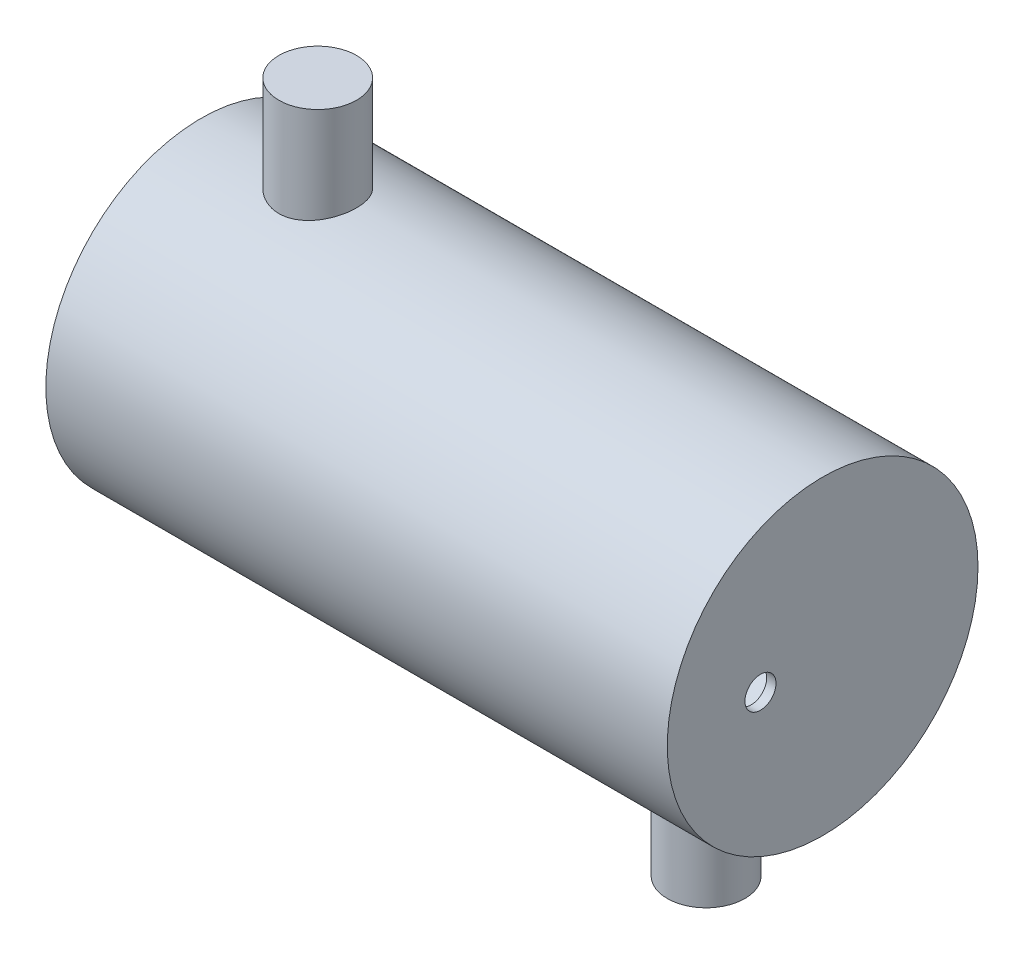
ISO-10303-21;
HEADER;
FILE_DESCRIPTION(('STEP AP214'),'2;1');
FILE_NAME('part.step','',(''),(''),'','','');
FILE_SCHEMA(('AUTOMOTIVE_DESIGN { 1 0 10303 214 1 1 1 1 }'));
ENDSEC;
DATA;
#1=APPLICATION_CONTEXT('core data for automotive mechanical design processes');
#2=APPLICATION_PROTOCOL_DEFINITION('international standard','automotive_design',2000,#1);
#3=PRODUCT_CONTEXT('',#1,'mechanical');
#4=PRODUCT('Part','Part','',(#3));
#5=PRODUCT_RELATED_PRODUCT_CATEGORY('part','',(#4));
#6=PRODUCT_DEFINITION_FORMATION('','',#4);
#7=PRODUCT_DEFINITION_CONTEXT('part definition',#1,'design');
#8=PRODUCT_DEFINITION('design','',#6,#7);
#9=PRODUCT_DEFINITION_SHAPE('','',#8);
#10=(LENGTH_UNIT() NAMED_UNIT(*) SI_UNIT(.MILLI.,.METRE.));
#11=(NAMED_UNIT(*) PLANE_ANGLE_UNIT() SI_UNIT($,.RADIAN.));
#12=(NAMED_UNIT(*) SI_UNIT($,.STERADIAN.) SOLID_ANGLE_UNIT());
#13=UNCERTAINTY_MEASURE_WITH_UNIT(LENGTH_MEASURE(1.E-05),#10,'distance_accuracy_value','');
#14=(GEOMETRIC_REPRESENTATION_CONTEXT(3) GLOBAL_UNCERTAINTY_ASSIGNED_CONTEXT((#13)) GLOBAL_UNIT_ASSIGNED_CONTEXT((#10,
#11,#12)) REPRESENTATION_CONTEXT('',''));
#15=CARTESIAN_POINT('',(0.,0.,0.));
#16=DIRECTION('',(0.,0.,1.));
#17=DIRECTION('',(1.,0.,0.));
#18=AXIS2_PLACEMENT_3D('',#15,#16,#17);
#19=CARTESIAN_POINT('',(100.,0.,0.));
#20=DIRECTION('',(-1.,0.,0.));
#21=DIRECTION('',(0.,0.,1.));
#22=AXIS2_PLACEMENT_3D('',#19,#20,#21);
#23=CYLINDRICAL_SURFACE('',#22,47.);
#24=CARTESIAN_POINT('',(63.8332334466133,-46.0491857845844,-9.40598153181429));
#25=CARTESIAN_POINT('',(63.573316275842,-46.041657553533,-9.44282879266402));
#26=CARTESIAN_POINT('',(63.3118776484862,-46.0362939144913,-9.46888779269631));
#27=CARTESIAN_POINT('',(62.7876111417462,-46.0300347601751,-9.49927301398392));
#28=CARTESIAN_POINT('',(62.5247830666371,-46.0291398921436,-9.50359608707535));
#29=CARTESIAN_POINT('',(61.9995526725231,-46.0318521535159,-9.49044886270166));
#30=CARTESIAN_POINT('',(61.7371506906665,-46.0354619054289,-9.47296587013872));
#31=CARTESIAN_POINT('',(61.2147896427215,-46.0470801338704,-9.41632875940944));
#32=CARTESIAN_POINT('',(60.9548306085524,-46.0550886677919,-9.37717435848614));
#33=CARTESIAN_POINT('',(60.4393936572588,-46.0752625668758,-9.27754036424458));
#34=CARTESIAN_POINT('',(60.1839126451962,-46.0874249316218,-9.21707616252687));
#35=CARTESIAN_POINT('',(59.6790214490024,-46.1155546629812,-9.07528710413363));
#36=CARTESIAN_POINT('',(59.42961131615,-46.1315220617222,-8.99396207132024));
#37=CARTESIAN_POINT('',(58.9386330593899,-46.1667996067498,-8.81108826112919));
#38=CARTESIAN_POINT('',(58.6970631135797,-46.1861089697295,-8.70954422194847));
#39=CARTESIAN_POINT('',(58.2232463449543,-46.2275339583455,-8.48692636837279));
#40=CARTESIAN_POINT('',(57.9910028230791,-46.2496505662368,-8.36584571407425));
#41=CARTESIAN_POINT('',(57.5353881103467,-46.2962799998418,-8.10384575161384));
#42=CARTESIAN_POINT('',(57.3121174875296,-46.3208128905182,-7.96275513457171));
#43=CARTESIAN_POINT('',(56.878202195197,-46.3714154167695,-7.66257082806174));
#44=CARTESIAN_POINT('',(56.6675579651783,-46.3974851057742,-7.50347651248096));
#45=CARTESIAN_POINT('',(56.2602750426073,-46.4504401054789,-7.16835991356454));
#46=CARTESIAN_POINT('',(56.063637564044,-46.4773254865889,-6.992336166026));
#47=CARTESIAN_POINT('',(55.6856870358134,-46.5311708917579,-6.62455046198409));
#48=CARTESIAN_POINT('',(55.5043741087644,-46.5581309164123,-6.4327883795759));
#49=CARTESIAN_POINT('',(55.1554400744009,-46.6118262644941,-6.03152425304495));
#50=CARTESIAN_POINT('',(54.9880926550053,-46.638550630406,-5.82178263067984));
#51=CARTESIAN_POINT('',(54.6716616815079,-46.6905613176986,-5.38878662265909));
#52=CARTESIAN_POINT('',(54.5225776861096,-46.7158476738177,-5.16553256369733));
#53=CARTESIAN_POINT('',(54.243715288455,-46.7642745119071,-4.70699275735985));
#54=CARTESIAN_POINT('',(54.113940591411,-46.787414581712,-4.4717047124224));
#55=CARTESIAN_POINT('',(53.8747418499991,-46.8308791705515,-3.9908643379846));
#56=CARTESIAN_POINT('',(53.7653098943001,-46.8512047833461,-3.74531604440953));
#57=CARTESIAN_POINT('',(53.5680119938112,-46.8883893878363,-3.24671412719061));
#58=CARTESIAN_POINT('',(53.4800524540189,-46.9052633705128,-2.9936986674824));
#59=CARTESIAN_POINT('',(53.3257614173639,-46.9351778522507,-2.4809329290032));
#60=CARTESIAN_POINT('',(53.2594298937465,-46.9482183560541,-2.22118265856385));
#61=CARTESIAN_POINT('',(53.1489342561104,-46.970091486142,-1.69686231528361));
#62=CARTESIAN_POINT('',(53.1047677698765,-46.9789245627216,-1.43229276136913));
#63=CARTESIAN_POINT('',(53.0389545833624,-46.9921305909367,-0.900258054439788));
#64=CARTESIAN_POINT('',(53.0173075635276,-46.996503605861,-0.63279294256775));
#65=CARTESIAN_POINT('',(52.9968959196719,-47.0006265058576,-0.101750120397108));
#66=CARTESIAN_POINT('',(52.9977290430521,-47.0004576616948,0.161811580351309));
#67=CARTESIAN_POINT('',(53.0212812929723,-46.995701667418,0.687912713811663));
#68=CARTESIAN_POINT('',(53.0440001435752,-46.9911145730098,0.950452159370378));
#69=CARTESIAN_POINT('',(53.1111407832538,-46.9776499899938,1.47262161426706));
#70=CARTESIAN_POINT('',(53.1555620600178,-46.9687726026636,1.73225169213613));
#71=CARTESIAN_POINT('',(53.2657562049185,-46.9469737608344,2.24676640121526));
#72=CARTESIAN_POINT('',(53.3315291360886,-46.9340522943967,2.50165101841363));
#73=CARTESIAN_POINT('',(53.483628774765,-46.9045777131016,3.00393879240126));
#74=CARTESIAN_POINT('',(53.569876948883,-46.888038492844,3.25136656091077));
#75=CARTESIAN_POINT('',(53.7624468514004,-46.8517437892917,3.73814112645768));
#76=CARTESIAN_POINT('',(53.8687758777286,-46.831987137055,3.97748494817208));
#77=CARTESIAN_POINT('',(54.1006997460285,-46.7897985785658,4.44636449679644));
#78=CARTESIAN_POINT('',(54.2262923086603,-46.7673669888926,4.67590138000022));
#79=CARTESIAN_POINT('',(54.495870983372,-46.7204288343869,5.12369208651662));
#80=CARTESIAN_POINT('',(54.639857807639,-46.6959221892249,5.34194547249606));
#81=CARTESIAN_POINT('',(54.9476829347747,-46.6450864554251,5.76913535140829));
#82=CARTESIAN_POINT('',(55.1118021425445,-46.6187344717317,5.97786674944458));
#83=CARTESIAN_POINT('',(55.4568771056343,-46.5652932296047,6.38081365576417));
#84=CARTESIAN_POINT('',(55.6378330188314,-46.5382039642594,6.57502902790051));
#85=CARTESIAN_POINT('',(56.0153751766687,-46.4840345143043,6.9476611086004));
#86=CARTESIAN_POINT('',(56.2119628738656,-46.4569543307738,7.12607634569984));
#87=CARTESIAN_POINT('',(56.6194333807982,-46.4035588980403,7.46587632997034));
#88=CARTESIAN_POINT('',(56.8303158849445,-46.3772436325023,7.62726144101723));
#89=CARTESIAN_POINT('',(57.2675645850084,-46.3258102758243,7.9337089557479));
#90=CARTESIAN_POINT('',(57.4940853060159,-46.3007101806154,8.07855401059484));
#91=CARTESIAN_POINT('',(57.9586817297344,-46.2527860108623,8.34856815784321));
#92=CARTESIAN_POINT('',(58.1967530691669,-46.2299610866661,8.47374460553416));
#93=CARTESIAN_POINT('',(58.6829016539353,-46.1872451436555,8.70356579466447));
#94=CARTESIAN_POINT('',(58.9309801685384,-46.1673544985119,8.80820792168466));
#95=CARTESIAN_POINT('',(59.4353509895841,-46.1311046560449,8.9961296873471));
#96=CARTESIAN_POINT('',(59.6916431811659,-46.1147454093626,9.07940962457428));
#97=CARTESIAN_POINT('',(60.2077217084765,-46.0862115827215,9.22314566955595));
#98=CARTESIAN_POINT('',(60.4674382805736,-46.0739928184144,9.28384348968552));
#99=CARTESIAN_POINT('',(60.9912177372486,-46.0538591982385,9.38320991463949));
#100=CARTESIAN_POINT('',(61.2552805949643,-46.0459443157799,9.42187865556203));
#101=CARTESIAN_POINT('',(61.7857933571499,-46.0346583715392,9.47686756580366));
#102=CARTESIAN_POINT('',(62.0522430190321,-46.0312868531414,9.49318998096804));
#103=CARTESIAN_POINT('',(62.5855878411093,-46.0291887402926,9.50335795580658));
#104=CARTESIAN_POINT('',(62.8524829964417,-46.0304620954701,9.49720375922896));
#105=CARTESIAN_POINT('',(63.3802265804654,-46.037553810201,9.46276584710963));
#106=CARTESIAN_POINT('',(63.6411007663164,-46.0432946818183,9.43485940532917));
#107=CARTESIAN_POINT('',(64.1595187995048,-46.0590585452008,9.35759998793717));
#108=CARTESIAN_POINT('',(64.4170626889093,-46.0690814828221,9.3082472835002));
#109=CARTESIAN_POINT('',(64.9269716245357,-46.0931159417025,9.18849204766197));
#110=CARTESIAN_POINT('',(65.1793375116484,-46.1071268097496,9.11809296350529));
#111=CARTESIAN_POINT('',(65.6772842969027,-46.1387404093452,8.95675090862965));
#112=CARTESIAN_POINT('',(65.9228626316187,-46.1563444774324,8.86580029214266));
#113=CARTESIAN_POINT('',(66.4063653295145,-46.194711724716,8.66367255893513));
#114=CARTESIAN_POINT('',(66.6442579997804,-46.2154863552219,8.55242182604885));
#115=CARTESIAN_POINT('',(67.1098458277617,-46.2595607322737,8.31072337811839));
#116=CARTESIAN_POINT('',(67.3375406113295,-46.2828605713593,8.18027495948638));
#117=CARTESIAN_POINT('',(67.7812399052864,-46.3313376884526,7.90108943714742));
#118=CARTESIAN_POINT('',(67.997243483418,-46.3565151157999,7.75235087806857));
#119=CARTESIAN_POINT('',(68.4161325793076,-46.4080532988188,7.43760787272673));
#120=CARTESIAN_POINT('',(68.6190179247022,-46.4344140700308,7.27160319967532));
#121=CARTESIAN_POINT('',(69.0139963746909,-46.488096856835,6.92018926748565));
#122=CARTESIAN_POINT('',(69.205818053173,-46.5154276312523,6.73447615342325));
#123=CARTESIAN_POINT('',(69.5731715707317,-46.5698051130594,6.34755140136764));
#124=CARTESIAN_POINT('',(69.7487036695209,-46.5968518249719,6.14634001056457));
#125=CARTESIAN_POINT('',(70.0823141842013,-46.6499126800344,5.72972454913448));
#126=CARTESIAN_POINT('',(70.2403884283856,-46.6759265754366,5.51431710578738));
#127=CARTESIAN_POINT('',(70.5378651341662,-46.7261787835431,5.07089496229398));
#128=CARTESIAN_POINT('',(70.6772746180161,-46.7504177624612,4.84288504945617));
#129=CARTESIAN_POINT('',(70.9371101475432,-46.7965639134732,4.37461029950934));
#130=CARTESIAN_POINT('',(71.0574412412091,-46.8184592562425,4.13429158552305));
#131=CARTESIAN_POINT('',(71.2773966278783,-46.8591613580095,3.64410131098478));
#132=CARTESIAN_POINT('',(71.3770208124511,-46.8779681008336,3.3942297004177));
#133=CARTESIAN_POINT('',(71.5547785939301,-46.9119536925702,2.88673917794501));
#134=CARTESIAN_POINT('',(71.6329141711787,-46.9271328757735,2.62912098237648));
#135=CARTESIAN_POINT('',(71.7670801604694,-46.9534284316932,2.10798874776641));
#136=CARTESIAN_POINT('',(71.8231109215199,-46.9645448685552,1.8444748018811));
#137=CARTESIAN_POINT('',(71.9118950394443,-46.9822509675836,1.31773487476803));
#138=CARTESIAN_POINT('',(71.9450055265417,-46.9889100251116,1.05457138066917));
#139=CARTESIAN_POINT('',(71.9891110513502,-46.9977952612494,0.526323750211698));
#140=CARTESIAN_POINT('',(72.0001063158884,-47.0000214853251,0.261239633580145));
#141=CARTESIAN_POINT('',(71.9998921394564,-46.9999782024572,-0.26890103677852));
#142=CARTESIAN_POINT('',(71.9886841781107,-46.9977089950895,-0.53395759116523));
#143=CARTESIAN_POINT('',(71.9441577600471,-46.9887395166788,-1.06213017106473));
#144=CARTESIAN_POINT('',(71.9108394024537,-46.982039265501,-1.32524620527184));
#145=CARTESIAN_POINT('',(71.8228834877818,-46.9645007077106,-1.84455447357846));
#146=CARTESIAN_POINT('',(71.7685016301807,-46.9537120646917,-2.10079175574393));
#147=CARTESIAN_POINT('',(71.6388071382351,-46.9282830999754,-2.60781567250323));
#148=CARTESIAN_POINT('',(71.5634869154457,-46.9136413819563,-2.85860029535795));
#149=CARTESIAN_POINT('',(71.3925102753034,-46.8809098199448,-3.35285403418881));
#150=CARTESIAN_POINT('',(71.2968574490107,-46.8628205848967,-3.59632443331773));
#151=CARTESIAN_POINT('',(71.0859090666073,-46.8236809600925,-4.07436186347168));
#152=CARTESIAN_POINT('',(70.9706127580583,-46.8026304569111,-4.30892855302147));
#153=CARTESIAN_POINT('',(70.7199364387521,-46.7579083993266,-4.76992459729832));
#154=CARTESIAN_POINT('',(70.5843644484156,-46.7342124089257,-4.99624718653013));
#155=CARTESIAN_POINT('',(70.2949782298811,-46.6850228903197,-5.43670427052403));
#156=CARTESIAN_POINT('',(70.1411638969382,-46.6595293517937,-5.65083869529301));
#157=CARTESIAN_POINT('',(69.8163080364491,-46.6074313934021,-6.06556149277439));
#158=CARTESIAN_POINT('',(69.6452619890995,-46.5808266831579,-6.2661462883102));
#159=CARTESIAN_POINT('',(69.2871307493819,-46.5272372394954,-6.65238430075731));
#160=CARTESIAN_POINT('',(69.1000457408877,-46.5002525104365,-6.83803768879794));
#161=CARTESIAN_POINT('',(68.7076951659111,-46.4461740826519,-7.19627004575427));
#162=CARTESIAN_POINT('',(68.5021705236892,-46.4190866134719,-7.36856635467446));
#163=CARTESIAN_POINT('',(68.0772788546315,-46.3660611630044,-7.69517660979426));
#164=CARTESIAN_POINT('',(67.8579167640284,-46.3401227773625,-7.84949691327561));
#165=CARTESIAN_POINT('',(67.4068841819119,-46.2901430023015,-8.13905716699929));
#166=CARTESIAN_POINT('',(67.1752201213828,-46.2661006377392,-8.27430695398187));
#167=CARTESIAN_POINT('',(66.7011622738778,-46.2206019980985,-8.52479527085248));
#168=CARTESIAN_POINT('',(66.4587703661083,-46.1991452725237,-8.64003728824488));
#169=CARTESIAN_POINT('',(65.8325093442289,-46.1488142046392,-8.90583882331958));
#170=CARTESIAN_POINT('',(65.4423658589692,-46.1221178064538,-9.04228021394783));
#171=CARTESIAN_POINT('',(64.6471470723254,-46.0782246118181,-9.26337077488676));
#172=CARTESIAN_POINT('',(64.2420724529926,-46.0610273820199,-9.34802230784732));
#173=CARTESIAN_POINT('',(63.8332334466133,-46.0491857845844,-9.40598153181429));
#174=B_SPLINE_CURVE_WITH_KNOTS('',3,(#24,#25,#26,#27,#28,#29,#30,#31,#32,#33,#34,#35,#36,#37,
#38,#39,#40,#41,#42,#43,#44,#45,#46,#47,#48,#49,#50,#51,#52,#53,#54,#55,#56,#57,#58,#59,#60,#61,
#62,#63,#64,#65,#66,#67,#68,#69,#70,#71,#72,#73,#74,#75,#76,#77,#78,#79,#80,#81,#82,#83,#84,#85,
#86,#87,#88,#89,#90,#91,#92,#93,#94,#95,#96,#97,#98,#99,#100,#101,#102,#103,#104,#105,#106,#107,
#108,#109,#110,#111,#112,#113,#114,#115,#116,#117,#118,#119,#120,#121,#122,#123,#124,#125,#126,
#127,#128,#129,#130,#131,#132,#133,#134,#135,#136,#137,#138,#139,#140,#141,#142,#143,#144,#145,
#146,#147,#148,#149,#150,#151,#152,#153,#154,#155,#156,#157,#158,#159,#160,#161,#162,#163,#164,
#165,#166,#167,#168,#169,#170,#171,#172,#173),.UNSPECIFIED.,.T.,.F.,(4,2,2,2,2,2,2,2,2,2,2,2,2,
2,2,2,2,2,2,2,2,2,2,2,2,2,2,2,2,2,2,2,2,2,2,2,2,2,2,2,2,2,2,2,2,2,2,2,2,2,2,2,2,2,2,2,2,2,2,2,2,
2,2,2,2,2,2,2,2,2,2,2,2,2,4),(0.,0.787515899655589,1.57514585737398,2.36323457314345,
3.15133357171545,3.93886450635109,4.72640209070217,5.51375533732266,6.30138484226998,
7.09621768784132,7.89107818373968,8.68600748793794,9.48094315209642,10.2889309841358,
11.0968992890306,11.905022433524,12.7128306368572,13.5170522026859,14.3212727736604,
15.1254072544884,15.9295303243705,16.7192743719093,17.5090084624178,18.2987239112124,
19.0884416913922,19.87517807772,20.6622009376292,21.4491307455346,22.2360910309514,
23.0356500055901,23.8352164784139,24.634857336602,25.4344811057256,26.2436305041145,
27.0524765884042,27.8614255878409,28.6703632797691,29.4703746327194,30.2703810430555,
31.0703070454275,31.8702243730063,32.6565684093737,33.4429025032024,34.2291078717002,
35.0156062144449,35.8050155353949,36.5944537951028,37.3839549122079,38.1734664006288,
38.9776843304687,39.78188943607,40.586286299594,41.3903796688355,42.1983571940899,
43.0063389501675,43.8142462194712,44.6221407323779,45.4171451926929,46.2121414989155,
47.0070848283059,47.8020245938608,48.5876022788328,49.3734650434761,50.1591891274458,
50.9449433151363,51.7386732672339,52.5324077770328,53.3263510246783,54.1202851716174,
54.9279913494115,55.7354110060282,56.5424126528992,57.3492734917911,58.5880600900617,
59.8267901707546),.UNSPECIFIED.);
#175=CARTESIAN_POINT('',(63.8332334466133,-46.0491857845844,-9.40598153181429));
#176=VERTEX_POINT('',#175);
#177=EDGE_CURVE('E32',#176,#176,#174,.T.);
#178=ORIENTED_EDGE('',*,*,#177,.F.);
#179=EDGE_LOOP('',(#178));
#180=FACE_BOUND('',#179,.T.);
#181=CARTESIAN_POINT('',(-97.,0.,0.));
#182=DIRECTION('',(1.,0.,0.));
#183=DIRECTION('',(0.,0.,-1.));
#184=AXIS2_PLACEMENT_3D('',#181,#182,#183);
#185=CIRCLE('',#184,47.);
#186=CARTESIAN_POINT('',(-97.,0.,-47.));
#187=VERTEX_POINT('',#186);
#188=EDGE_CURVE('E94',#187,#187,#185,.T.);
#189=ORIENTED_EDGE('',*,*,#188,.F.);
#190=EDGE_LOOP('',(#189));
#191=FACE_BOUND('',#190,.T.);
#192=CARTESIAN_POINT('',(97.,0.,0.));
#193=DIRECTION('',(1.,0.,0.));
#194=DIRECTION('',(0.,0.,-1.));
#195=AXIS2_PLACEMENT_3D('',#192,#193,#194);
#196=CIRCLE('',#195,47.);
#197=CARTESIAN_POINT('',(97.,0.,-47.));
#198=VERTEX_POINT('',#197);
#199=EDGE_CURVE('E59',#198,#198,#196,.T.);
#200=ORIENTED_EDGE('',*,*,#199,.T.);
#201=EDGE_LOOP('',(#200));
#202=FACE_BOUND('',#201,.T.);
#203=CARTESIAN_POINT('',(-63.8332334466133,46.0491857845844,9.40598153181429));
#204=CARTESIAN_POINT('',(-63.573316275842,46.041657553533,9.44282879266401));
#205=CARTESIAN_POINT('',(-63.3118776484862,46.0362939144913,9.4688877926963));
#206=CARTESIAN_POINT('',(-62.7876111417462,46.0300347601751,9.49927301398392));
#207=CARTESIAN_POINT('',(-62.5247830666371,46.0291398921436,9.50359608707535));
#208=CARTESIAN_POINT('',(-61.9995526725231,46.0318521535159,9.49044886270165));
#209=CARTESIAN_POINT('',(-61.7371506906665,46.0354619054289,9.47296587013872));
#210=CARTESIAN_POINT('',(-61.2147896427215,46.0470801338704,9.41632875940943));
#211=CARTESIAN_POINT('',(-60.9548306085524,46.0550886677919,9.37717435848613));
#212=CARTESIAN_POINT('',(-60.4393936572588,46.0752625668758,9.27754036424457));
#213=CARTESIAN_POINT('',(-60.1839126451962,46.0874249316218,9.21707616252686));
#214=CARTESIAN_POINT('',(-59.6790214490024,46.1155546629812,9.07528710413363));
#215=CARTESIAN_POINT('',(-59.42961131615,46.1315220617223,8.99396207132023));
#216=CARTESIAN_POINT('',(-58.9386330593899,46.1667996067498,8.81108826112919));
#217=CARTESIAN_POINT('',(-58.6970631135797,46.1861089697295,8.70954422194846));
#218=CARTESIAN_POINT('',(-58.2232463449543,46.2275339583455,8.48692636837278));
#219=CARTESIAN_POINT('',(-57.9910028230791,46.2496505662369,8.36584571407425));
#220=CARTESIAN_POINT('',(-57.5353881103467,46.2962799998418,8.10384575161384));
#221=CARTESIAN_POINT('',(-57.3121174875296,46.3208128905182,7.9627551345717));
#222=CARTESIAN_POINT('',(-56.878202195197,46.3714154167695,7.66257082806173));
#223=CARTESIAN_POINT('',(-56.6675579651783,46.3974851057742,7.50347651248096));
#224=CARTESIAN_POINT('',(-56.2602750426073,46.4504401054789,7.16835991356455));
#225=CARTESIAN_POINT('',(-56.063637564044,46.4773254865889,6.992336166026));
#226=CARTESIAN_POINT('',(-55.6856870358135,46.5311708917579,6.62455046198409));
#227=CARTESIAN_POINT('',(-55.5043741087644,46.5581309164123,6.4327883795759));
#228=CARTESIAN_POINT('',(-55.1554400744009,46.6118262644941,6.03152425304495));
#229=CARTESIAN_POINT('',(-54.9880926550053,46.638550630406,5.82178263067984));
#230=CARTESIAN_POINT('',(-54.6716616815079,46.6905613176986,5.38878662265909));
#231=CARTESIAN_POINT('',(-54.5225776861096,46.7158476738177,5.16553256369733));
#232=CARTESIAN_POINT('',(-54.243715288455,46.7642745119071,4.70699275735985));
#233=CARTESIAN_POINT('',(-54.113940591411,46.787414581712,4.4717047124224));
#234=CARTESIAN_POINT('',(-53.8747418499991,46.8308791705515,3.9908643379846));
#235=CARTESIAN_POINT('',(-53.7653098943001,46.8512047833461,3.74531604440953));
#236=CARTESIAN_POINT('',(-53.5680119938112,46.8883893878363,3.24671412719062));
#237=CARTESIAN_POINT('',(-53.4800524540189,46.9052633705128,2.9936986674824));
#238=CARTESIAN_POINT('',(-53.3257614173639,46.9351778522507,2.48093292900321));
#239=CARTESIAN_POINT('',(-53.2594298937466,46.9482183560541,2.22118265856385));
#240=CARTESIAN_POINT('',(-53.1489342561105,46.970091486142,1.69686231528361));
#241=CARTESIAN_POINT('',(-53.1047677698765,46.9789245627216,1.43229276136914));
#242=CARTESIAN_POINT('',(-53.0389545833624,46.9921305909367,0.900258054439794));
#243=CARTESIAN_POINT('',(-53.0173075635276,46.996503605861,0.632792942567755));
#244=CARTESIAN_POINT('',(-52.9968959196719,47.0006265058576,0.101750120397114));
#245=CARTESIAN_POINT('',(-52.9977290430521,47.0004576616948,-0.161811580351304));
#246=CARTESIAN_POINT('',(-53.0212812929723,46.995701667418,-0.68791271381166));
#247=CARTESIAN_POINT('',(-53.0440001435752,46.9911145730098,-0.950452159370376));
#248=CARTESIAN_POINT('',(-53.1111407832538,46.9776499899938,-1.47262161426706));
#249=CARTESIAN_POINT('',(-53.1555620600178,46.9687726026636,-1.73225169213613));
#250=CARTESIAN_POINT('',(-53.2657562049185,46.9469737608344,-2.24676640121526));
#251=CARTESIAN_POINT('',(-53.3315291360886,46.9340522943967,-2.50165101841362));
#252=CARTESIAN_POINT('',(-53.483628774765,46.9045777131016,-3.00393879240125));
#253=CARTESIAN_POINT('',(-53.569876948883,46.888038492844,-3.25136656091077));
#254=CARTESIAN_POINT('',(-53.7624468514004,46.8517437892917,-3.73814112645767));
#255=CARTESIAN_POINT('',(-53.8687758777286,46.831987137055,-3.97748494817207));
#256=CARTESIAN_POINT('',(-54.1006997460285,46.7897985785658,-4.44636449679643));
#257=CARTESIAN_POINT('',(-54.2262923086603,46.7673669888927,-4.67590138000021));
#258=CARTESIAN_POINT('',(-54.495870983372,46.7204288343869,-5.12369208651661));
#259=CARTESIAN_POINT('',(-54.639857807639,46.6959221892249,-5.34194547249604));
#260=CARTESIAN_POINT('',(-54.9476829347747,46.6450864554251,-5.76913535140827));
#261=CARTESIAN_POINT('',(-55.1118021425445,46.6187344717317,-5.97786674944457));
#262=CARTESIAN_POINT('',(-55.4568771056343,46.5652932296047,-6.38081365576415));
#263=CARTESIAN_POINT('',(-55.6378330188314,46.5382039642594,-6.5750290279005));
#264=CARTESIAN_POINT('',(-56.0153751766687,46.4840345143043,-6.94766110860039));
#265=CARTESIAN_POINT('',(-56.2119628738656,46.4569543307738,-7.12607634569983));
#266=CARTESIAN_POINT('',(-56.6194333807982,46.4035588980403,-7.46587632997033));
#267=CARTESIAN_POINT('',(-56.8303158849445,46.3772436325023,-7.62726144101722));
#268=CARTESIAN_POINT('',(-57.2675645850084,46.3258102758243,-7.93370895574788));
#269=CARTESIAN_POINT('',(-57.4940853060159,46.3007101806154,-8.07855401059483));
#270=CARTESIAN_POINT('',(-57.9586817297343,46.2527860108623,-8.3485681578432));
#271=CARTESIAN_POINT('',(-58.1967530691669,46.2299610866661,-8.47374460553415));
#272=CARTESIAN_POINT('',(-58.6829016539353,46.1872451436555,-8.70356579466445));
#273=CARTESIAN_POINT('',(-58.9309801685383,46.1673544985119,-8.80820792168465));
#274=CARTESIAN_POINT('',(-59.4353509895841,46.1311046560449,-8.99612968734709));
#275=CARTESIAN_POINT('',(-59.6916431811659,46.1147454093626,-9.07940962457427));
#276=CARTESIAN_POINT('',(-60.2077217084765,46.0862115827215,-9.22314566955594));
#277=CARTESIAN_POINT('',(-60.4674382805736,46.0739928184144,-9.28384348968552));
#278=CARTESIAN_POINT('',(-60.9912177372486,46.0538591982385,-9.38320991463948));
#279=CARTESIAN_POINT('',(-61.2552805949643,46.0459443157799,-9.42187865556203));
#280=CARTESIAN_POINT('',(-61.7857933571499,46.0346583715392,-9.47686756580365));
#281=CARTESIAN_POINT('',(-62.0522430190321,46.0312868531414,-9.49318998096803));
#282=CARTESIAN_POINT('',(-62.5855878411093,46.0291887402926,-9.50335795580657));
#283=CARTESIAN_POINT('',(-62.8524829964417,46.0304620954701,-9.49720375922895));
#284=CARTESIAN_POINT('',(-63.3802265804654,46.037553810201,-9.46276584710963));
#285=CARTESIAN_POINT('',(-63.6411007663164,46.0432946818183,-9.43485940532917));
#286=CARTESIAN_POINT('',(-64.1595187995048,46.0590585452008,-9.35759998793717));
#287=CARTESIAN_POINT('',(-64.4170626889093,46.0690814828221,-9.30824728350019));
#288=CARTESIAN_POINT('',(-64.9269716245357,46.0931159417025,-9.18849204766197));
#289=CARTESIAN_POINT('',(-65.1793375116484,46.1071268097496,-9.11809296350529));
#290=CARTESIAN_POINT('',(-65.6772842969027,46.1387404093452,-8.95675090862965));
#291=CARTESIAN_POINT('',(-65.9228626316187,46.1563444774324,-8.86580029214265));
#292=CARTESIAN_POINT('',(-66.4063653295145,46.194711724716,-8.66367255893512));
#293=CARTESIAN_POINT('',(-66.6442579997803,46.2154863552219,-8.55242182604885));
#294=CARTESIAN_POINT('',(-67.1098458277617,46.2595607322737,-8.31072337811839));
#295=CARTESIAN_POINT('',(-67.3375406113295,46.2828605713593,-8.18027495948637));
#296=CARTESIAN_POINT('',(-67.7812399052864,46.3313376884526,-7.90108943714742));
#297=CARTESIAN_POINT('',(-67.997243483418,46.3565151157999,-7.75235087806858));
#298=CARTESIAN_POINT('',(-68.4161325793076,46.4080532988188,-7.43760787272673));
#299=CARTESIAN_POINT('',(-68.6190179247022,46.4344140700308,-7.27160319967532));
#300=CARTESIAN_POINT('',(-69.0139963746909,46.488096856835,-6.92018926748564));
#301=CARTESIAN_POINT('',(-69.205818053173,46.5154276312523,-6.73447615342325));
#302=CARTESIAN_POINT('',(-69.5731715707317,46.5698051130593,-6.34755140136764));
#303=CARTESIAN_POINT('',(-69.7487036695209,46.5968518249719,-6.14634001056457));
#304=CARTESIAN_POINT('',(-70.0823141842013,46.6499126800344,-5.72972454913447));
#305=CARTESIAN_POINT('',(-70.2403884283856,46.6759265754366,-5.51431710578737));
#306=CARTESIAN_POINT('',(-70.5378651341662,46.7261787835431,-5.07089496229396));
#307=CARTESIAN_POINT('',(-70.6772746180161,46.7504177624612,-4.84288504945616));
#308=CARTESIAN_POINT('',(-70.9371101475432,46.7965639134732,-4.37461029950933));
#309=CARTESIAN_POINT('',(-71.0574412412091,46.8184592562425,-4.13429158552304));
#310=CARTESIAN_POINT('',(-71.2773966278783,46.8591613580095,-3.64410131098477));
#311=CARTESIAN_POINT('',(-71.3770208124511,46.8779681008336,-3.3942297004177));
#312=CARTESIAN_POINT('',(-71.5547785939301,46.9119536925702,-2.886739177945));
#313=CARTESIAN_POINT('',(-71.6329141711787,46.9271328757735,-2.62912098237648));
#314=CARTESIAN_POINT('',(-71.7670801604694,46.9534284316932,-2.1079887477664));
#315=CARTESIAN_POINT('',(-71.8231109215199,46.9645448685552,-1.84447480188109));
#316=CARTESIAN_POINT('',(-71.9118950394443,46.9822509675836,-1.31773487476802));
#317=CARTESIAN_POINT('',(-71.9450055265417,46.9889100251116,-1.05457138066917));
#318=CARTESIAN_POINT('',(-71.9891110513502,46.9977952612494,-0.526323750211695));
#319=CARTESIAN_POINT('',(-72.0001063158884,47.000021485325,-0.261239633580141));
#320=CARTESIAN_POINT('',(-71.9998921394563,46.9999782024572,0.268901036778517));
#321=CARTESIAN_POINT('',(-71.9886841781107,46.9977089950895,0.533957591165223));
#322=CARTESIAN_POINT('',(-71.9441577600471,46.9887395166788,1.06213017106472));
#323=CARTESIAN_POINT('',(-71.9108394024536,46.982039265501,1.32524620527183));
#324=CARTESIAN_POINT('',(-71.8228834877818,46.9645007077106,1.84455447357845));
#325=CARTESIAN_POINT('',(-71.7685016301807,46.9537120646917,2.10079175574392));
#326=CARTESIAN_POINT('',(-71.6388071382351,46.9282830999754,2.60781567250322));
#327=CARTESIAN_POINT('',(-71.5634869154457,46.9136413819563,2.85860029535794));
#328=CARTESIAN_POINT('',(-71.3925102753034,46.8809098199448,3.3528540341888));
#329=CARTESIAN_POINT('',(-71.2968574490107,46.8628205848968,3.59632443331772));
#330=CARTESIAN_POINT('',(-71.0859090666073,46.8236809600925,4.07436186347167));
#331=CARTESIAN_POINT('',(-70.9706127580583,46.8026304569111,4.30892855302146));
#332=CARTESIAN_POINT('',(-70.7199364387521,46.7579083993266,4.76992459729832));
#333=CARTESIAN_POINT('',(-70.5843644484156,46.7342124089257,4.99624718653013));
#334=CARTESIAN_POINT('',(-70.2949782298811,46.6850228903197,5.43670427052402));
#335=CARTESIAN_POINT('',(-70.1411638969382,46.6595293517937,5.650838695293));
#336=CARTESIAN_POINT('',(-69.8163080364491,46.6074313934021,6.06556149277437));
#337=CARTESIAN_POINT('',(-69.6452619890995,46.5808266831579,6.26614628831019));
#338=CARTESIAN_POINT('',(-69.2871307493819,46.5272372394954,6.6523843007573));
#339=CARTESIAN_POINT('',(-69.1000457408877,46.5002525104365,6.83803768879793));
#340=CARTESIAN_POINT('',(-68.7076951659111,46.4461740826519,7.19627004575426));
#341=CARTESIAN_POINT('',(-68.5021705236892,46.4190866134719,7.36856635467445));
#342=CARTESIAN_POINT('',(-68.0772788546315,46.3660611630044,7.69517660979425));
#343=CARTESIAN_POINT('',(-67.8579167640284,46.3401227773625,7.84949691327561));
#344=CARTESIAN_POINT('',(-67.4068841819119,46.2901430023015,8.13905716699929));
#345=CARTESIAN_POINT('',(-67.1752201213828,46.2661006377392,8.27430695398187));
#346=CARTESIAN_POINT('',(-66.7011622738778,46.2206019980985,8.52479527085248));
#347=CARTESIAN_POINT('',(-66.4587703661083,46.1991452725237,8.64003728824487));
#348=CARTESIAN_POINT('',(-65.8325093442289,46.1488142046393,8.90583882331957));
#349=CARTESIAN_POINT('',(-65.4423658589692,46.1221178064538,9.04228021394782));
#350=CARTESIAN_POINT('',(-64.6471470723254,46.0782246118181,9.26337077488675));
#351=CARTESIAN_POINT('',(-64.2420724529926,46.0610273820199,9.34802230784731));
#352=CARTESIAN_POINT('',(-63.8332334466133,46.0491857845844,9.40598153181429));
#353=B_SPLINE_CURVE_WITH_KNOTS('',3,(#203,#204,#205,#206,#207,#208,#209,#210,#211,#212,#213,
#214,#215,#216,#217,#218,#219,#220,#221,#222,#223,#224,#225,#226,#227,#228,#229,#230,#231,#232,
#233,#234,#235,#236,#237,#238,#239,#240,#241,#242,#243,#244,#245,#246,#247,#248,#249,#250,#251,
#252,#253,#254,#255,#256,#257,#258,#259,#260,#261,#262,#263,#264,#265,#266,#267,#268,#269,#270,
#271,#272,#273,#274,#275,#276,#277,#278,#279,#280,#281,#282,#283,#284,#285,#286,#287,#288,#289,
#290,#291,#292,#293,#294,#295,#296,#297,#298,#299,#300,#301,#302,#303,#304,#305,#306,#307,#308,
#309,#310,#311,#312,#313,#314,#315,#316,#317,#318,#319,#320,#321,#322,#323,#324,#325,#326,#327,
#328,#329,#330,#331,#332,#333,#334,#335,#336,#337,#338,#339,#340,#341,#342,#343,#344,#345,#346,
#347,#348,#349,#350,#351,#352),.UNSPECIFIED.,.T.,.F.,(4,2,2,2,2,2,2,2,2,2,2,2,2,2,2,2,2,2,2,2,2,
2,2,2,2,2,2,2,2,2,2,2,2,2,2,2,2,2,2,2,2,2,2,2,2,2,2,2,2,2,2,2,2,2,2,2,2,2,2,2,2,2,2,2,2,2,2,2,2,
2,2,2,2,2,4),(0.,0.787515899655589,1.57514585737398,2.36323457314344,3.15133357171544,
3.93886450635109,4.72640209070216,5.51375533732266,6.30138484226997,7.09621768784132,
7.89107818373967,8.68600748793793,9.4809431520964,10.2889309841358,11.0968992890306,
11.905022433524,12.7128306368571,13.5170522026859,14.3212727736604,15.1254072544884,
15.9295303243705,16.7192743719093,17.5090084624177,18.2987239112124,19.0884416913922,
19.87517807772,20.6622009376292,21.4491307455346,22.2360910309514,23.0356500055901,
23.8352164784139,24.634857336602,25.4344811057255,26.2436305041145,27.0524765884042,
27.8614255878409,28.670363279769,29.4703746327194,30.2703810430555,31.0703070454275,
31.8702243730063,32.6565684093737,33.4429025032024,34.2291078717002,35.0156062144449,
35.8050155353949,36.5944537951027,37.3839549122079,38.1734664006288,38.9776843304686,
39.78188943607,40.586286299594,41.3903796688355,42.1983571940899,43.0063389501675,
43.8142462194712,44.6221407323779,45.4171451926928,46.2121414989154,47.0070848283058,
47.8020245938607,48.5876022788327,49.373465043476,50.1591891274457,50.9449433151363,
51.7386732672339,52.5324077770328,53.3263510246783,54.1202851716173,54.9279913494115,
55.7354110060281,56.5424126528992,57.3492734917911,58.5880600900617,59.8267901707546),.UNSPECIFIED.);
#354=CARTESIAN_POINT('',(-63.8332334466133,46.0491857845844,9.40598153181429));
#355=VERTEX_POINT('',#354);
#356=EDGE_CURVE('E44',#355,#355,#353,.T.);
#357=ORIENTED_EDGE('',*,*,#356,.T.);
#358=EDGE_LOOP('',(#357));
#359=FACE_BOUND('',#358,.T.);
#360=ADVANCED_FACE('F28',(#180,#191,#202,#359),#23,.F.);
#361=CARTESIAN_POINT('',(97.,0.,0.));
#362=DIRECTION('',(1.,0.,0.));
#363=DIRECTION('',(0.,0.,-1.));
#364=AXIS2_PLACEMENT_3D('',#361,#362,#363);
#365=PLANE('',#364);
#366=CARTESIAN_POINT('',(97.,0.,20.));
#367=DIRECTION('',(1.,0.,0.));
#368=DIRECTION('',(0.,0.,-1.));
#369=AXIS2_PLACEMENT_3D('',#366,#367,#368);
#370=CIRCLE('',#369,5.);
#371=CARTESIAN_POINT('',(97.,0.,15.));
#372=VERTEX_POINT('',#371);
#373=EDGE_CURVE('E152',#372,#372,#370,.F.);
#374=ORIENTED_EDGE('',*,*,#373,.F.);
#375=EDGE_LOOP('',(#374));
#376=FACE_BOUND('',#375,.T.);
#377=ORIENTED_EDGE('',*,*,#199,.F.);
#378=EDGE_LOOP('',(#377));
#379=FACE_BOUND('',#378,.T.);
#380=ADVANCED_FACE('F82',(#376,#379),#365,.F.);
#381=CARTESIAN_POINT('',(-97.,0.,0.));
#382=DIRECTION('',(1.,0.,0.));
#383=DIRECTION('',(0.,0.,-1.));
#384=AXIS2_PLACEMENT_3D('',#381,#382,#383);
#385=PLANE('',#384);
#386=CARTESIAN_POINT('',(-97.,0.,-20.));
#387=DIRECTION('',(1.,0.,0.));
#388=DIRECTION('',(0.,0.,-1.));
#389=AXIS2_PLACEMENT_3D('',#386,#387,#388);
#390=CIRCLE('',#389,5.);
#391=CARTESIAN_POINT('',(-97.,0.,-15.));
#392=VERTEX_POINT('',#391);
#393=EDGE_CURVE('E156',#392,#392,#390,.F.);
#394=ORIENTED_EDGE('',*,*,#393,.T.);
#395=EDGE_LOOP('',(#394));
#396=FACE_BOUND('',#395,.T.);
#397=ORIENTED_EDGE('',*,*,#188,.T.);
#398=EDGE_LOOP('',(#397));
#399=FACE_BOUND('',#398,.T.);
#400=ADVANCED_FACE('F68',(#396,#399),#385,.T.);
#401=CARTESIAN_POINT('',(-62.5,80.,0.));
#402=DIRECTION('',(0.,-1.,0.));
#403=DIRECTION('',(0.,0.,-1.));
#404=AXIS2_PLACEMENT_3D('',#401,#402,#403);
#405=CYLINDRICAL_SURFACE('',#404,9.49999999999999);
#406=CARTESIAN_POINT('',(-62.5,77.,0.));
#407=DIRECTION('',(0.,1.,0.));
#408=DIRECTION('',(0.,0.,1.));
#409=AXIS2_PLACEMENT_3D('',#406,#407,#408);
#410=CIRCLE('',#409,9.49999999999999);
#411=CARTESIAN_POINT('',(-62.5,77.,9.49999999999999));
#412=VERTEX_POINT('',#411);
#413=EDGE_CURVE('E39',#412,#412,#410,.T.);
#414=ORIENTED_EDGE('',*,*,#413,.T.);
#415=EDGE_LOOP('',(#414));
#416=FACE_BOUND('',#415,.T.);
#417=ORIENTED_EDGE('',*,*,#356,.F.);
#418=EDGE_LOOP('',(#417));
#419=FACE_BOUND('',#418,.T.);
#420=ADVANCED_FACE('F62',(#416,#419),#405,.F.);
#421=CARTESIAN_POINT('',(-118.423393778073,77.,0.));
#422=DIRECTION('',(0.,1.,0.));
#423=DIRECTION('',(0.,0.,1.));
#424=AXIS2_PLACEMENT_3D('',#421,#422,#423);
#425=PLANE('',#424);
#426=ORIENTED_EDGE('',*,*,#413,.F.);
#427=EDGE_LOOP('',(#426));
#428=FACE_BOUND('',#427,.T.);
#429=ADVANCED_FACE('F67',(#428),#425,.F.);
#430=CARTESIAN_POINT('',(62.5,-80.,0.));
#431=DIRECTION('',(0.,1.,0.));
#432=DIRECTION('',(0.,0.,1.));
#433=AXIS2_PLACEMENT_3D('',#430,#431,#432);
#434=CYLINDRICAL_SURFACE('',#433,9.5);
#435=CARTESIAN_POINT('',(62.5,-77.,0.));
#436=DIRECTION('',(0.,1.,0.));
#437=DIRECTION('',(0.,0.,1.));
#438=AXIS2_PLACEMENT_3D('',#435,#436,#437);
#439=CIRCLE('',#438,9.5);
#440=CARTESIAN_POINT('',(62.5,-77.,9.5));
#441=VERTEX_POINT('',#440);
#442=EDGE_CURVE('E10',#441,#441,#439,.T.);
#443=ORIENTED_EDGE('',*,*,#442,.F.);
#444=EDGE_LOOP('',(#443));
#445=FACE_BOUND('',#444,.T.);
#446=ORIENTED_EDGE('',*,*,#177,.T.);
#447=EDGE_LOOP('',(#446));
#448=FACE_BOUND('',#447,.T.);
#449=ADVANCED_FACE('F71',(#445,#448),#434,.F.);
#450=CARTESIAN_POINT('',(62.5,-77.,0.));
#451=DIRECTION('',(0.,1.,0.));
#452=DIRECTION('',(0.,0.,1.));
#453=AXIS2_PLACEMENT_3D('',#450,#451,#452);
#454=PLANE('',#453);
#455=ORIENTED_EDGE('',*,*,#442,.T.);
#456=EDGE_LOOP('',(#455));
#457=FACE_BOUND('',#456,.T.);
#458=ADVANCED_FACE('F30',(#457),#454,.T.);
#459=CARTESIAN_POINT('',(-100.001,0.,20.));
#460=DIRECTION('',(1.,0.,0.));
#461=DIRECTION('',(0.,0.,-1.));
#462=AXIS2_PLACEMENT_3D('',#459,#460,#461);
#463=CYLINDRICAL_SURFACE('',#462,5.);
#464=CARTESIAN_POINT('',(100.,0.,20.));
#465=DIRECTION('',(1.,0.,0.));
#466=DIRECTION('',(0.,0.,-1.));
#467=AXIS2_PLACEMENT_3D('',#464,#465,#466);
#468=CIRCLE('',#467,5.);
#469=CARTESIAN_POINT('',(100.,0.,15.));
#470=VERTEX_POINT('',#469);
#471=EDGE_CURVE('E149',#470,#470,#468,.T.);
#472=CARTESIAN_POINT('',(100.,0.,15.));
#473=CARTESIAN_POINT('',(99.96875,0.,15.));
#474=CARTESIAN_POINT('',(99.9375,0.,15.));
#475=CARTESIAN_POINT('',(99.875,0.,15.));
#476=CARTESIAN_POINT('',(99.84375,0.,15.));
#477=CARTESIAN_POINT('',(99.78125,0.,15.));
#478=CARTESIAN_POINT('',(99.75,0.,15.));
#479=CARTESIAN_POINT('',(99.6875,0.,15.));
#480=CARTESIAN_POINT('',(99.65625,0.,15.));
#481=CARTESIAN_POINT('',(99.59375,0.,15.));
#482=CARTESIAN_POINT('',(99.5625,0.,15.));
#483=CARTESIAN_POINT('',(99.5,0.,15.));
#484=CARTESIAN_POINT('',(99.46875,0.,15.));
#485=CARTESIAN_POINT('',(99.40625,0.,15.));
#486=CARTESIAN_POINT('',(99.375,0.,15.));
#487=CARTESIAN_POINT('',(99.3125,0.,15.));
#488=CARTESIAN_POINT('',(99.28125,0.,15.));
#489=CARTESIAN_POINT('',(99.21875,0.,15.));
#490=CARTESIAN_POINT('',(99.1875,0.,15.));
#491=CARTESIAN_POINT('',(99.125,0.,15.));
#492=CARTESIAN_POINT('',(99.09375,0.,15.));
#493=CARTESIAN_POINT('',(99.03125,0.,15.));
#494=CARTESIAN_POINT('',(99.,0.,15.));
#495=CARTESIAN_POINT('',(98.9375,0.,15.));
#496=CARTESIAN_POINT('',(98.90625,0.,15.));
#497=CARTESIAN_POINT('',(98.84375,0.,15.));
#498=CARTESIAN_POINT('',(98.8125,0.,15.));
#499=CARTESIAN_POINT('',(98.75,0.,15.));
#500=CARTESIAN_POINT('',(98.71875,0.,15.));
#501=CARTESIAN_POINT('',(98.65625,0.,15.));
#502=CARTESIAN_POINT('',(98.625,0.,15.));
#503=CARTESIAN_POINT('',(98.5625,0.,15.));
#504=CARTESIAN_POINT('',(98.53125,0.,15.));
#505=CARTESIAN_POINT('',(98.46875,0.,15.));
#506=CARTESIAN_POINT('',(98.4375,0.,15.));
#507=CARTESIAN_POINT('',(98.375,0.,15.));
#508=CARTESIAN_POINT('',(98.34375,0.,15.));
#509=CARTESIAN_POINT('',(98.28125,0.,15.));
#510=CARTESIAN_POINT('',(98.25,0.,15.));
#511=CARTESIAN_POINT('',(98.1875,0.,15.));
#512=CARTESIAN_POINT('',(98.15625,0.,15.));
#513=CARTESIAN_POINT('',(98.09375,0.,15.));
#514=CARTESIAN_POINT('',(98.0625,0.,15.));
#515=CARTESIAN_POINT('',(98.,0.,15.));
#516=CARTESIAN_POINT('',(97.96875,0.,15.));
#517=CARTESIAN_POINT('',(97.90625,0.,15.));
#518=CARTESIAN_POINT('',(97.875,0.,15.));
#519=CARTESIAN_POINT('',(97.8125,0.,15.));
#520=CARTESIAN_POINT('',(97.78125,0.,15.));
#521=CARTESIAN_POINT('',(97.71875,0.,15.));
#522=CARTESIAN_POINT('',(97.6875,0.,15.));
#523=CARTESIAN_POINT('',(97.625,0.,15.));
#524=CARTESIAN_POINT('',(97.59375,0.,15.));
#525=CARTESIAN_POINT('',(97.53125,0.,15.));
#526=CARTESIAN_POINT('',(97.5,0.,15.));
#527=CARTESIAN_POINT('',(97.4375,0.,15.));
#528=CARTESIAN_POINT('',(97.40625,0.,15.));
#529=CARTESIAN_POINT('',(97.34375,0.,15.));
#530=CARTESIAN_POINT('',(97.3125,0.,15.));
#531=CARTESIAN_POINT('',(97.25,0.,15.));
#532=CARTESIAN_POINT('',(97.21875,0.,15.));
#533=CARTESIAN_POINT('',(97.15625,0.,15.));
#534=CARTESIAN_POINT('',(97.125,0.,15.));
#535=CARTESIAN_POINT('',(97.0625,0.,15.));
#536=CARTESIAN_POINT('',(97.03125,0.,15.));
#537=CARTESIAN_POINT('',(97.,0.,15.));
#538=B_SPLINE_CURVE_WITH_KNOTS('',3,(#472,#473,#474,#475,#476,#477,#478,#479,#480,#481,#482,
#483,#484,#485,#486,#487,#488,#489,#490,#491,#492,#493,#494,#495,#496,#497,#498,#499,#500,#501,
#502,#503,#504,#505,#506,#507,#508,#509,#510,#511,#512,#513,#514,#515,#516,#517,#518,#519,#520,
#521,#522,#523,#524,#525,#526,#527,#528,#529,#530,#531,#532,#533,#534,#535,#536,#537),
.UNSPECIFIED.,.F.,.F.,(4,2,2,2,2,2,2,2,2,2,2,2,2,2,2,2,2,2,2,2,2,2,2,2,2,2,2,2,2,2,2,2,4),(0.,
0.0937500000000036,0.187500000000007,0.281250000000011,0.375000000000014,0.46874999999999,
0.562499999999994,0.656249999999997,0.750000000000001,0.843750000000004,0.937500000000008,
1.03125000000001,1.12499999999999,1.21874999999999,1.31249999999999,1.40625,1.5,1.59375,
1.68750000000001,1.78125000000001,1.87500000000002,1.96874999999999,2.06249999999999,2.15625,
2.25,2.34375000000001,2.43750000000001,2.53125000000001,2.62499999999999,2.71874999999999,
2.8125,2.90625,3.),.UNSPECIFIED.);
#539=EDGE_CURVE('BSEAM79',#470,#372,#538,.T.);
#540=ORIENTED_EDGE('',*,*,#471,.T.);
#541=ORIENTED_EDGE('',*,*,#373,.T.);
#542=ORIENTED_EDGE('',*,*,#539,.T.);
#543=ORIENTED_EDGE('',*,*,#539,.F.);
#544=EDGE_LOOP('',(#540,#542,#541,#543));
#545=FACE_BOUND('',#544,.T.);
#546=ADVANCED_FACE('F79',(#545),#463,.F.);
#547=CARTESIAN_POINT('',(100.,0.,0.));
#548=DIRECTION('',(-1.,0.,0.));
#549=DIRECTION('',(0.,0.,1.));
#550=AXIS2_PLACEMENT_3D('',#547,#548,#549);
#551=CYLINDRICAL_SURFACE('',#550,50.);
#552=CARTESIAN_POINT('',(62.5,-48.4122918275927,12.5));
#553=CARTESIAN_POINT('',(62.8451559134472,-48.4122927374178,12.4999985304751));
#554=CARTESIAN_POINT('',(63.19034118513,-48.4159930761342,12.4856918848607));
#555=CARTESIAN_POINT('',(63.8782119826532,-48.4306842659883,12.4285828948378));
#556=CARTESIAN_POINT('',(64.2208972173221,-48.4416759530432,12.3857772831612));
#557=CARTESIAN_POINT('',(64.9014461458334,-48.4706231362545,12.2720061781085));
#558=CARTESIAN_POINT('',(65.2393072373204,-48.4885822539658,12.2010260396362));
#559=CARTESIAN_POINT('',(65.9076142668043,-48.5309242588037,12.0315007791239));
#560=CARTESIAN_POINT('',(66.2380603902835,-48.5553069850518,11.9329563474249));
#561=CARTESIAN_POINT('',(66.8888391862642,-48.6097407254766,11.7092411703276));
#562=CARTESIAN_POINT('',(67.2091845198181,-48.6397842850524,11.5841054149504));
#563=CARTESIAN_POINT('',(67.8380734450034,-48.7046936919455,11.3080899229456));
#564=CARTESIAN_POINT('',(68.1466169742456,-48.7395595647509,11.1572100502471));
#565=CARTESIAN_POINT('',(68.7498954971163,-48.8131288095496,10.8308092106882));
#566=CARTESIAN_POINT('',(69.0446305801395,-48.8518321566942,10.6552884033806));
#567=CARTESIAN_POINT('',(69.6184359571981,-48.9320079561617,10.2808194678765));
#568=CARTESIAN_POINT('',(69.8975055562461,-48.9734805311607,10.0818703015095));
#569=CARTESIAN_POINT('',(70.4435887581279,-49.0589077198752,9.65770596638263));
#570=CARTESIAN_POINT('',(70.7102534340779,-49.1028952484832,9.43204808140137));
#571=CARTESIAN_POINT('',(71.2237301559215,-49.1913558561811,8.95925964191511));
#572=CARTESIAN_POINT('',(71.4705419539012,-49.2358289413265,8.71212881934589));
#573=CARTESIAN_POINT('',(71.9427139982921,-49.3240411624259,8.19798665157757));
#574=CARTESIAN_POINT('',(72.168071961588,-49.3677802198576,7.93097319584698));
#575=CARTESIAN_POINT('',(72.595779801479,-49.4533199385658,7.37883292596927));
#576=CARTESIAN_POINT('',(72.7981303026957,-49.4951206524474,7.09370660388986));
#577=CARTESIAN_POINT('',(73.1810821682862,-49.5762039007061,6.50308227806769));
#578=CARTESIAN_POINT('',(73.3613391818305,-49.615442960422,6.1973548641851));
#579=CARTESIAN_POINT('',(73.6953962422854,-49.6896403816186,5.57126537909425));
#580=CARTESIAN_POINT('',(73.849195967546,-49.7245986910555,5.25090313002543));
#581=CARTESIAN_POINT('',(74.1291095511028,-49.7892321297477,4.59782650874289));
#582=CARTESIAN_POINT('',(74.255226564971,-49.818907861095,4.26511354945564));
#583=CARTESIAN_POINT('',(74.4787543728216,-49.8721240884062,3.58970337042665));
#584=CARTESIAN_POINT('',(74.5761658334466,-49.8956647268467,3.24700638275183));
#585=CARTESIAN_POINT('',(74.7397738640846,-49.9355173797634,2.56118856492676));
#586=CARTESIAN_POINT('',(74.8065627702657,-49.9519661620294,2.21821693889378));
#587=CARTESIAN_POINT('',(74.9112174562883,-49.9778525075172,1.52762618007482));
#588=CARTESIAN_POINT('',(74.9490835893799,-49.9872901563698,1.18000710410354));
#589=CARTESIAN_POINT('',(74.9955604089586,-49.9988852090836,0.482742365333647));
#590=CARTESIAN_POINT('',(75.0041748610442,-50.0010435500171,0.13309696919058));
#591=CARTESIAN_POINT('',(74.9920827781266,-49.9980209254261,-0.565652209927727));
#592=CARTESIAN_POINT('',(74.9713766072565,-49.9928400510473,-0.914755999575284));
#593=CARTESIAN_POINT('',(74.9016116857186,-49.9754826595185,-1.60208990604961));
#594=CARTESIAN_POINT('',(74.8531932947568,-49.9634641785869,-1.940389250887));
#595=CARTESIAN_POINT('',(74.7289021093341,-49.9328791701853,-2.61159773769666));
#596=CARTESIAN_POINT('',(74.6530297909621,-49.9143127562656,-2.94450697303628));
#597=CARTESIAN_POINT('',(74.4744387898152,-49.8711307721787,-3.60264965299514));
#598=CARTESIAN_POINT('',(74.3717192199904,-49.8465150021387,-3.92788284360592));
#599=CARTESIAN_POINT('',(74.1402330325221,-49.7918907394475,-4.56847527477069));
#600=CARTESIAN_POINT('',(74.0114660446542,-49.7618821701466,-4.88383437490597));
#601=CARTESIAN_POINT('',(73.727571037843,-49.6969726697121,-5.50540053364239));
#602=CARTESIAN_POINT('',(73.57221579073,-49.6620300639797,-5.81149942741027));
#603=CARTESIAN_POINT('',(73.2370933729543,-49.5883904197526,-6.40954937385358));
#604=CARTESIAN_POINT('',(73.0573261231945,-49.5496933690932,-6.70150038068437));
#605=CARTESIAN_POINT('',(72.6746012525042,-49.4695613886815,-7.26944043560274));
#606=CARTESIAN_POINT('',(72.4716405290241,-49.4281260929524,-7.54542734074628));
#607=CARTESIAN_POINT('',(72.043893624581,-49.3436111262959,-8.07967831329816));
#608=CARTESIAN_POINT('',(71.8191065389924,-49.300531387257,-8.33794164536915));
#609=CARTESIAN_POINT('',(71.3427911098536,-49.212688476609,-8.8418592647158));
#610=CARTESIAN_POINT('',(71.0907034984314,-49.1679113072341,-9.0869827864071));
#611=CARTESIAN_POINT('',(70.5667078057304,-49.0790700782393,-9.55519113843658));
#612=CARTESIAN_POINT('',(70.2947993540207,-49.0350060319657,-9.77827555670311));
#613=CARTESIAN_POINT('',(69.7329328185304,-48.9488331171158,-10.2008952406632));
#614=CARTESIAN_POINT('',(69.4429734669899,-48.9067243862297,-10.4004288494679));
#615=CARTESIAN_POINT('',(68.8469504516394,-48.8256759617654,-10.7745073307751));
#616=CARTESIAN_POINT('',(68.5408873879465,-48.7867361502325,-10.9490531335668));
#617=CARTESIAN_POINT('',(67.91316655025,-48.7129835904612,-11.2726626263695));
#618=CARTESIAN_POINT('',(67.5914397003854,-48.6781920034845,-11.4215972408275));
#619=CARTESIAN_POINT('',(66.9360269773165,-48.6140102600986,-11.6917620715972));
#620=CARTESIAN_POINT('',(66.6023410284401,-48.5846201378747,-11.8129921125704));
#621=CARTESIAN_POINT('',(65.9254674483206,-48.5321544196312,-12.0267247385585));
#622=CARTESIAN_POINT('',(65.5822814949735,-48.5090777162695,-12.1192323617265));
#623=CARTESIAN_POINT('',(64.8888967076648,-48.4699601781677,-12.2747465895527));
#624=CARTESIAN_POINT('',(64.5386980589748,-48.4539191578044,-12.3377539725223));
#625=CARTESIAN_POINT('',(63.8432627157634,-48.4297098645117,-12.4324383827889));
#626=CARTESIAN_POINT('',(63.4981394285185,-48.4213447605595,-12.4648992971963));
#627=CARTESIAN_POINT('',(62.8062915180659,-48.412025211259,-12.5010467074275));
#628=CARTESIAN_POINT('',(62.4595669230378,-48.4110706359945,-12.504733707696));
#629=CARTESIAN_POINT('',(61.7671000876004,-48.4166012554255,-12.4833025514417));
#630=CARTESIAN_POINT('',(61.4213577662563,-48.4230858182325,-12.458186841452));
#631=CARTESIAN_POINT('',(60.7333629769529,-48.4432943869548,-12.3793731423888));
#632=CARTESIAN_POINT('',(60.3911104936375,-48.4570183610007,-12.3256752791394));
#633=CARTESIAN_POINT('',(59.7181417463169,-48.4910057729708,-12.1912702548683));
#634=CARTESIAN_POINT('',(59.3873283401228,-48.5111582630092,-12.1110205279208));
#635=CARTESIAN_POINT('',(58.7337390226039,-48.5574757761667,-11.9239599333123));
#636=CARTESIAN_POINT('',(58.4109629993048,-48.5836407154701,-11.8171494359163));
#637=CARTESIAN_POINT('',(57.7755676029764,-48.6412390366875,-11.5777807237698));
#638=CARTESIAN_POINT('',(57.4629489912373,-48.6726728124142,-11.445220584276));
#639=CARTESIAN_POINT('',(56.8498977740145,-48.7399302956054,-11.1553271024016));
#640=CARTESIAN_POINT('',(56.5494657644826,-48.7757542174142,-10.9979925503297));
#641=CARTESIAN_POINT('',(55.9569351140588,-48.8515472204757,-10.6563378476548));
#642=CARTESIAN_POINT('',(55.6651151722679,-48.8915837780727,-10.4715492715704));
#643=CARTESIAN_POINT('',(55.0979875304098,-48.9740856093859,-10.0786515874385));
#644=CARTESIAN_POINT('',(54.8226800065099,-49.0165509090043,-9.87054223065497));
#645=CARTESIAN_POINT('',(54.290280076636,-49.1027542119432,-9.43235813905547));
#646=CARTESIAN_POINT('',(54.0331905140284,-49.1464924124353,-9.2022799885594));
#647=CARTESIAN_POINT('',(53.5389118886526,-49.23405248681,-8.72168121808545));
#648=CARTESIAN_POINT('',(53.3017226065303,-49.2778743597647,-8.47116082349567));
#649=CARTESIAN_POINT('',(52.8430885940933,-49.3655142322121,-7.94474395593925));
#650=CARTESIAN_POINT('',(52.6221876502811,-49.4093045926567,-7.66836875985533));
#651=CARTESIAN_POINT('',(52.2044427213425,-49.4945115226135,-7.09764484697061));
#652=CARTESIAN_POINT('',(52.0075991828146,-49.5359280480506,-6.80329579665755));
#653=CARTESIAN_POINT('',(51.6394076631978,-49.615220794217,-6.19861496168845));
#654=CARTESIAN_POINT('',(51.4680588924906,-49.6530971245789,-5.88828367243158));
#655=CARTESIAN_POINT('',(51.1521552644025,-49.7242383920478,-5.25376217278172));
#656=CARTESIAN_POINT('',(51.0076000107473,-49.7575033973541,-4.92957216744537));
#657=CARTESIAN_POINT('',(50.7473895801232,-49.8182492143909,-4.27203083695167));
#658=CARTESIAN_POINT('',(50.6315306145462,-49.8457705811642,-3.93876393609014));
#659=CARTESIAN_POINT('',(50.4283002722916,-49.894550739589,-3.26320127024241));
#660=CARTESIAN_POINT('',(50.3409288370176,-49.9158095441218,-2.92090552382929));
#661=CARTESIAN_POINT('',(50.195431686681,-49.9514506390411,-2.22985593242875));
#662=CARTESIAN_POINT('',(50.1373012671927,-49.9658340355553,-1.88110313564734));
#663=CARTESIAN_POINT('',(50.0507774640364,-49.9873121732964,-1.1797076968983));
#664=CARTESIAN_POINT('',(50.0223834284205,-49.9944070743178,-0.827065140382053));
#665=CARTESIAN_POINT('',(49.9959463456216,-50.0010120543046,-0.130141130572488));
#666=CARTESIAN_POINT('',(49.9971026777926,-50.0007222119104,0.214108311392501));
#667=CARTESIAN_POINT('',(50.0277904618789,-49.9930574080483,0.901255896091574));
#668=CARTESIAN_POINT('',(50.0573213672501,-49.9856825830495,1.24415406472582));
#669=CARTESIAN_POINT('',(50.1445061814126,-49.9640515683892,1.92612085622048));
#670=CARTESIAN_POINT('',(50.2021591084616,-49.9497956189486,2.26518961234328));
#671=CARTESIAN_POINT('',(50.345108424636,-49.9147933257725,2.93710554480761));
#672=CARTESIAN_POINT('',(50.4304049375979,-49.8940469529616,3.26995269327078));
#673=CARTESIAN_POINT('',(50.6274165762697,-49.8467566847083,3.92532997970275));
#674=CARTESIAN_POINT('',(50.7389861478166,-49.820244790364,4.24790622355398));
#675=CARTESIAN_POINT('',(50.9879283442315,-49.7620654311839,4.88245471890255));
#676=CARTESIAN_POINT('',(51.1253007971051,-49.7303980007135,5.19442704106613));
#677=CARTESIAN_POINT('',(51.4248495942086,-49.6627393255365,5.80576625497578));
#678=CARTESIAN_POINT('',(51.5870280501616,-49.6267477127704,6.10513207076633));
#679=CARTESIAN_POINT('',(51.9350430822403,-49.5513820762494,6.68934218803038));
#680=CARTESIAN_POINT('',(52.1208806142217,-49.5120079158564,6.97418590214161));
#681=CARTESIAN_POINT('',(52.5196818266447,-49.4299279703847,7.53420368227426));
#682=CARTESIAN_POINT('',(52.7331886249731,-49.3871649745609,7.80898271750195));
#683=CARTESIAN_POINT('',(53.1822426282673,-49.3003254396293,8.33967777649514));
#684=CARTESIAN_POINT('',(53.4177902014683,-49.2562488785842,8.59559348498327));
#685=CARTESIAN_POINT('',(53.909379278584,-49.1679805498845,9.0869137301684));
#686=CARTESIAN_POINT('',(54.165421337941,-49.123788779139,9.32231771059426));
#687=CARTESIAN_POINT('',(54.6964513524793,-49.0364840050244,9.77115884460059));
#688=CARTESIAN_POINT('',(54.9714475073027,-48.9933714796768,9.98458639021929));
#689=CARTESIAN_POINT('',(55.5438276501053,-48.9086572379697,10.3916936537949));
#690=CARTESIAN_POINT('',(55.8415342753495,-48.8670988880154,10.58492911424));
#691=CARTESIAN_POINT('',(56.4525267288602,-48.787603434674,10.9454938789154));
#692=CARTESIAN_POINT('',(56.7658055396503,-48.7496647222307,11.1128347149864));
#693=CARTESIAN_POINT('',(57.4057778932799,-48.6785375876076,11.4203717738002));
#694=CARTESIAN_POINT('',(57.7324659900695,-48.6453472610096,11.5605788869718));
#695=CARTESIAN_POINT('',(58.3970410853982,-48.5847182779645,11.812789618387));
#696=CARTESIAN_POINT('',(58.7349263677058,-48.5572787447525,11.9247975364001));
#697=CARTESIAN_POINT('',(59.3546588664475,-48.5135700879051,12.1012442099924));
#698=CARTESIAN_POINT('',(59.6350176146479,-48.4961698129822,12.1706732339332));
#699=CARTESIAN_POINT('',(60.2001053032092,-48.4660700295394,12.2899899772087));
#700=CARTESIAN_POINT('',(60.4848339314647,-48.4533701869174,12.3398790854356));
#701=CARTESIAN_POINT('',(61.0572654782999,-48.4329398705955,12.4198245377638));
#702=CARTESIAN_POINT('',(61.3449686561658,-48.4252098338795,12.4498791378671));
#703=CARTESIAN_POINT('',(61.9217746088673,-48.4148860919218,12.489964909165));
#704=CARTESIAN_POINT('',(62.2108770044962,-48.4122910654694,12.5000012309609));
#705=CARTESIAN_POINT('',(62.5,-48.4122918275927,12.5));
#706=B_SPLINE_CURVE_WITH_KNOTS('',3,(#552,#553,#554,#555,#556,#557,#558,#559,#560,#561,#562,
#563,#564,#565,#566,#567,#568,#569,#570,#571,#572,#573,#574,#575,#576,#577,#578,#579,#580,#581,
#582,#583,#584,#585,#586,#587,#588,#589,#590,#591,#592,#593,#594,#595,#596,#597,#598,#599,#600,
#601,#602,#603,#604,#605,#606,#607,#608,#609,#610,#611,#612,#613,#614,#615,#616,#617,#618,#619,
#620,#621,#622,#623,#624,#625,#626,#627,#628,#629,#630,#631,#632,#633,#634,#635,#636,#637,#638,
#639,#640,#641,#642,#643,#644,#645,#646,#647,#648,#649,#650,#651,#652,#653,#654,#655,#656,#657,
#658,#659,#660,#661,#662,#663,#664,#665,#666,#667,#668,#669,#670,#671,#672,#673,#674,#675,#676,
#677,#678,#679,#680,#681,#682,#683,#684,#685,#686,#687,#688,#689,#690,#691,#692,#693,#694,#695,
#696,#697,#698,#699,#700,#701,#702,#703,#704,#705),.UNSPECIFIED.,.T.,.F.,(4,2,2,2,2,2,2,2,2,2,2,
2,2,2,2,2,2,2,2,2,2,2,2,2,2,2,2,2,2,2,2,2,2,2,2,2,2,2,2,2,2,2,2,2,2,2,2,2,2,2,2,2,2,2,2,2,2,2,2,
2,2,2,2,2,2,2,2,2,2,2,2,2,2,2,2,2,4),(0.,1.03520353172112,2.07052576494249,3.10638686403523,
4.14222202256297,5.17670253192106,6.21118850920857,7.24566778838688,8.28019292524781,
9.33523798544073,10.3902962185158,11.4454666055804,12.5006083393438,13.5705298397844,
14.6404643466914,15.7102768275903,16.7800644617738,17.8281818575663,18.8762864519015,
19.9242561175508,20.9722127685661,21.9968787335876,23.0215269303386,24.0462089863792,
25.0709056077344,26.1048419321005,27.1387816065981,28.172859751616,29.2069807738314,
30.2691027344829,31.3312445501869,32.3934610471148,33.455637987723,34.5230204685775,
35.5904097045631,36.6576116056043,37.7247853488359,38.7637598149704,39.802716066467,
40.8415840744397,41.8804475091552,42.9022721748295,43.9240825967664,44.945969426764,
45.9679061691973,47.009870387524,48.0518457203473,49.0939833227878,50.1361094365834,
51.2043614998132,52.2726333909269,53.3408721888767,54.4090951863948,55.4694993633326,
56.5299013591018,57.5901326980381,58.6503407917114,59.6818554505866,60.7133502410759,
61.7448090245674,62.7762724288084,63.8021505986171,64.8280219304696,65.8539806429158,
66.8799808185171,67.9305561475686,68.9811490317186,70.0317703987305,71.0828491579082,
72.1535959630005,73.2238645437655,74.2937026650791,75.3633775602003,76.2307338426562,
77.0980284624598,77.9653993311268,78.8325470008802),.UNSPECIFIED.);
#707=CARTESIAN_POINT('',(62.5,-48.4122918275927,12.5));
#708=VERTEX_POINT('',#707);
#709=EDGE_CURVE('E47',#708,#708,#706,.T.);
#710=ORIENTED_EDGE('',*,*,#709,.T.);
#711=EDGE_LOOP('',(#710));
#712=FACE_BOUND('',#711,.T.);
#713=CARTESIAN_POINT('',(-100.,0.,0.));
#714=DIRECTION('',(1.,0.,0.));
#715=DIRECTION('',(0.,0.,-1.));
#716=AXIS2_PLACEMENT_3D('',#713,#714,#715);
#717=CIRCLE('',#716,50.);
#718=CARTESIAN_POINT('',(-100.,0.,-50.));
#719=VERTEX_POINT('',#718);
#720=EDGE_CURVE('E108',#719,#719,#717,.T.);
#721=ORIENTED_EDGE('',*,*,#720,.T.);
#722=EDGE_LOOP('',(#721));
#723=FACE_BOUND('',#722,.T.);
#724=CARTESIAN_POINT('',(100.,0.,0.));
#725=DIRECTION('',(1.,0.,0.));
#726=DIRECTION('',(0.,0.,-1.));
#727=AXIS2_PLACEMENT_3D('',#724,#725,#726);
#728=CIRCLE('',#727,50.);
#729=CARTESIAN_POINT('',(100.,0.,-50.));
#730=VERTEX_POINT('',#729);
#731=EDGE_CURVE('E104',#730,#730,#728,.T.);
#732=ORIENTED_EDGE('',*,*,#731,.F.);
#733=EDGE_LOOP('',(#732));
#734=FACE_BOUND('',#733,.T.);
#735=CARTESIAN_POINT('',(-62.5,48.4122918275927,-12.5));
#736=CARTESIAN_POINT('',(-62.8451559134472,48.4122927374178,-12.4999985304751));
#737=CARTESIAN_POINT('',(-63.19034118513,48.4159930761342,-12.4856918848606));
#738=CARTESIAN_POINT('',(-63.8782119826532,48.4306842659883,-12.4285828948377));
#739=CARTESIAN_POINT('',(-64.2208972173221,48.4416759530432,-12.3857772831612));
#740=CARTESIAN_POINT('',(-64.9014461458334,48.4706231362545,-12.2720061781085));
#741=CARTESIAN_POINT('',(-65.2393072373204,48.4885822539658,-12.2010260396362));
#742=CARTESIAN_POINT('',(-65.9076142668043,48.5309242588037,-12.0315007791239));
#743=CARTESIAN_POINT('',(-66.2380603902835,48.5553069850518,-11.9329563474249));
#744=CARTESIAN_POINT('',(-66.8888391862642,48.6097407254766,-11.7092411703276));
#745=CARTESIAN_POINT('',(-67.2091845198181,48.6397842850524,-11.5841054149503));
#746=CARTESIAN_POINT('',(-67.8380734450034,48.7046936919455,-11.3080899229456));
#747=CARTESIAN_POINT('',(-68.1466169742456,48.7395595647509,-11.1572100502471));
#748=CARTESIAN_POINT('',(-68.7498954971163,48.8131288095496,-10.8308092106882));
#749=CARTESIAN_POINT('',(-69.0446305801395,48.8518321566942,-10.6552884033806));
#750=CARTESIAN_POINT('',(-69.6184359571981,48.9320079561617,-10.2808194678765));
#751=CARTESIAN_POINT('',(-69.8975055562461,48.9734805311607,-10.0818703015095));
#752=CARTESIAN_POINT('',(-70.4435887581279,49.0589077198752,-9.65770596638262));
#753=CARTESIAN_POINT('',(-70.7102534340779,49.1028952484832,-9.43204808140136));
#754=CARTESIAN_POINT('',(-71.2237301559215,49.1913558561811,-8.9592596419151));
#755=CARTESIAN_POINT('',(-71.4705419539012,49.2358289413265,-8.71212881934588));
#756=CARTESIAN_POINT('',(-71.9427139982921,49.3240411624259,-8.19798665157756));
#757=CARTESIAN_POINT('',(-72.168071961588,49.3677802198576,-7.93097319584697));
#758=CARTESIAN_POINT('',(-72.595779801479,49.4533199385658,-7.37883292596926));
#759=CARTESIAN_POINT('',(-72.7981303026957,49.4951206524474,-7.09370660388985));
#760=CARTESIAN_POINT('',(-73.1810821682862,49.5762039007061,-6.50308227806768));
#761=CARTESIAN_POINT('',(-73.3613391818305,49.615442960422,-6.19735486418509));
#762=CARTESIAN_POINT('',(-73.6953962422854,49.6896403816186,-5.57126537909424));
#763=CARTESIAN_POINT('',(-73.849195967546,49.7245986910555,-5.25090313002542));
#764=CARTESIAN_POINT('',(-74.1291095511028,49.7892321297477,-4.59782650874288));
#765=CARTESIAN_POINT('',(-74.255226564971,49.818907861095,-4.26511354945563));
#766=CARTESIAN_POINT('',(-74.4787543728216,49.8721240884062,-3.58970337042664));
#767=CARTESIAN_POINT('',(-74.5761658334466,49.8956647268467,-3.24700638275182));
#768=CARTESIAN_POINT('',(-74.7397738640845,49.9355173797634,-2.56118856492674));
#769=CARTESIAN_POINT('',(-74.8065627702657,49.9519661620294,-2.21821693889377));
#770=CARTESIAN_POINT('',(-74.9112174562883,49.9778525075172,-1.52762618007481));
#771=CARTESIAN_POINT('',(-74.9490835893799,49.9872901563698,-1.18000710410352));
#772=CARTESIAN_POINT('',(-74.9955604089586,49.9988852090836,-0.482742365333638));
#773=CARTESIAN_POINT('',(-75.0041748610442,50.0010435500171,-0.133096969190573));
#774=CARTESIAN_POINT('',(-74.9920827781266,49.9980209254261,0.565652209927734));
#775=CARTESIAN_POINT('',(-74.9713766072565,49.9928400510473,0.914755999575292));
#776=CARTESIAN_POINT('',(-74.9016116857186,49.9754826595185,1.60208990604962));
#777=CARTESIAN_POINT('',(-74.8531932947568,49.9634641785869,1.94038925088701));
#778=CARTESIAN_POINT('',(-74.7289021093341,49.9328791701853,2.61159773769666));
#779=CARTESIAN_POINT('',(-74.6530297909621,49.9143127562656,2.94450697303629));
#780=CARTESIAN_POINT('',(-74.4744387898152,49.8711307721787,3.60264965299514));
#781=CARTESIAN_POINT('',(-74.3717192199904,49.8465150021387,3.92788284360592));
#782=CARTESIAN_POINT('',(-74.1402330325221,49.7918907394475,4.56847527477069));
#783=CARTESIAN_POINT('',(-74.0114660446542,49.7618821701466,4.88383437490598));
#784=CARTESIAN_POINT('',(-73.727571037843,49.6969726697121,5.50540053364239));
#785=CARTESIAN_POINT('',(-73.57221579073,49.6620300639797,5.81149942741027));
#786=CARTESIAN_POINT('',(-73.2370933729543,49.5883904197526,6.40954937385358));
#787=CARTESIAN_POINT('',(-73.0573261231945,49.5496933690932,6.70150038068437));
#788=CARTESIAN_POINT('',(-72.6746012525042,49.4695613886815,7.26944043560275));
#789=CARTESIAN_POINT('',(-72.4716405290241,49.4281260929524,7.54542734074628));
#790=CARTESIAN_POINT('',(-72.043893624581,49.3436111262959,8.07967831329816));
#791=CARTESIAN_POINT('',(-71.8191065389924,49.300531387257,8.33794164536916));
#792=CARTESIAN_POINT('',(-71.3427911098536,49.212688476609,8.8418592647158));
#793=CARTESIAN_POINT('',(-71.0907034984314,49.1679113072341,9.0869827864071));
#794=CARTESIAN_POINT('',(-70.5667078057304,49.0790700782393,9.55519113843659));
#795=CARTESIAN_POINT('',(-70.2947993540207,49.0350060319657,9.77827555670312));
#796=CARTESIAN_POINT('',(-69.7329328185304,48.9488331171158,10.2008952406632));
#797=CARTESIAN_POINT('',(-69.4429734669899,48.9067243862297,10.4004288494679));
#798=CARTESIAN_POINT('',(-68.8469504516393,48.8256759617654,10.7745073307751));
#799=CARTESIAN_POINT('',(-68.5408873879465,48.7867361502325,10.9490531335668));
#800=CARTESIAN_POINT('',(-67.91316655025,48.7129835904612,11.2726626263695));
#801=CARTESIAN_POINT('',(-67.5914397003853,48.6781920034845,11.4215972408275));
#802=CARTESIAN_POINT('',(-66.9360269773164,48.6140102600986,11.6917620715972));
#803=CARTESIAN_POINT('',(-66.6023410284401,48.5846201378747,11.8129921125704));
#804=CARTESIAN_POINT('',(-65.9254674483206,48.5321544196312,12.0267247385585));
#805=CARTESIAN_POINT('',(-65.5822814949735,48.5090777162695,12.1192323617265));
#806=CARTESIAN_POINT('',(-64.8888967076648,48.4699601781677,12.2747465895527));
#807=CARTESIAN_POINT('',(-64.5386980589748,48.4539191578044,12.3377539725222));
#808=CARTESIAN_POINT('',(-63.8432627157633,48.4297098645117,12.4324383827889));
#809=CARTESIAN_POINT('',(-63.4981394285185,48.4213447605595,12.4648992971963));
#810=CARTESIAN_POINT('',(-62.8062915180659,48.4120252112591,12.5010467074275));
#811=CARTESIAN_POINT('',(-62.4595669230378,48.4110706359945,12.504733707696));
#812=CARTESIAN_POINT('',(-61.7671000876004,48.4166012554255,12.4833025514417));
#813=CARTESIAN_POINT('',(-61.4213577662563,48.4230858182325,12.458186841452));
#814=CARTESIAN_POINT('',(-60.7333629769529,48.4432943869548,12.3793731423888));
#815=CARTESIAN_POINT('',(-60.3911104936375,48.4570183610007,12.3256752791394));
#816=CARTESIAN_POINT('',(-59.7181417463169,48.4910057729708,12.1912702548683));
#817=CARTESIAN_POINT('',(-59.3873283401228,48.5111582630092,12.1110205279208));
#818=CARTESIAN_POINT('',(-58.7337390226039,48.5574757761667,11.9239599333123));
#819=CARTESIAN_POINT('',(-58.4109629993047,48.5836407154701,11.8171494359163));
#820=CARTESIAN_POINT('',(-57.7755676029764,48.6412390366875,11.5777807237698));
#821=CARTESIAN_POINT('',(-57.4629489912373,48.6726728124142,11.4452205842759));
#822=CARTESIAN_POINT('',(-56.8498977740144,48.7399302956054,11.1553271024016));
#823=CARTESIAN_POINT('',(-56.5494657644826,48.7757542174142,10.9979925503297));
#824=CARTESIAN_POINT('',(-55.9569351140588,48.8515472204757,10.6563378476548));
#825=CARTESIAN_POINT('',(-55.6651151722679,48.8915837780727,10.4715492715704));
#826=CARTESIAN_POINT('',(-55.0979875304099,48.9740856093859,10.0786515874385));
#827=CARTESIAN_POINT('',(-54.8226800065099,49.0165509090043,9.87054223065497));
#828=CARTESIAN_POINT('',(-54.2902800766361,49.1027542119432,9.43235813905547));
#829=CARTESIAN_POINT('',(-54.0331905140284,49.1464924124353,9.20227998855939));
#830=CARTESIAN_POINT('',(-53.5389118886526,49.23405248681,8.72168121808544));
#831=CARTESIAN_POINT('',(-53.3017226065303,49.2778743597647,8.47116082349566));
#832=CARTESIAN_POINT('',(-52.8430885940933,49.3655142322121,7.94474395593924));
#833=CARTESIAN_POINT('',(-52.6221876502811,49.4093045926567,7.66836875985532));
#834=CARTESIAN_POINT('',(-52.2044427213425,49.4945115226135,7.0976448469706));
#835=CARTESIAN_POINT('',(-52.0075991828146,49.5359280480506,6.80329579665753));
#836=CARTESIAN_POINT('',(-51.6394076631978,49.615220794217,6.19861496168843));
#837=CARTESIAN_POINT('',(-51.4680588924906,49.6530971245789,5.88828367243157));
#838=CARTESIAN_POINT('',(-51.1521552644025,49.7242383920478,5.2537621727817));
#839=CARTESIAN_POINT('',(-51.0076000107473,49.7575033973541,4.92957216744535));
#840=CARTESIAN_POINT('',(-50.7473895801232,49.8182492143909,4.27203083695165));
#841=CARTESIAN_POINT('',(-50.6315306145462,49.8457705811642,3.93876393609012));
#842=CARTESIAN_POINT('',(-50.4283002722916,49.894550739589,3.2632012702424));
#843=CARTESIAN_POINT('',(-50.3409288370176,49.9158095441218,2.92090552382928));
#844=CARTESIAN_POINT('',(-50.195431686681,49.9514506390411,2.22985593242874));
#845=CARTESIAN_POINT('',(-50.1373012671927,49.9658340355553,1.88110313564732));
#846=CARTESIAN_POINT('',(-50.0507774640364,49.9873121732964,1.1797076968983));
#847=CARTESIAN_POINT('',(-50.0223834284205,49.9944070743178,0.827065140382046));
#848=CARTESIAN_POINT('',(-49.9959463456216,50.0010120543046,0.13014113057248));
#849=CARTESIAN_POINT('',(-49.9971026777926,50.0007222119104,-0.214108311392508));
#850=CARTESIAN_POINT('',(-50.0277904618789,49.9930574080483,-0.901255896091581));
#851=CARTESIAN_POINT('',(-50.0573213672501,49.9856825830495,-1.24415406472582));
#852=CARTESIAN_POINT('',(-50.1445061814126,49.9640515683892,-1.92612085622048));
#853=CARTESIAN_POINT('',(-50.2021591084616,49.9497956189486,-2.26518961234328));
#854=CARTESIAN_POINT('',(-50.345108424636,49.9147933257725,-2.93710554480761));
#855=CARTESIAN_POINT('',(-50.4304049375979,49.8940469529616,-3.26995269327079));
#856=CARTESIAN_POINT('',(-50.6274165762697,49.8467566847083,-3.92532997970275));
#857=CARTESIAN_POINT('',(-50.7389861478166,49.820244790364,-4.24790622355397));
#858=CARTESIAN_POINT('',(-50.9879283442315,49.7620654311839,-4.88245471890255));
#859=CARTESIAN_POINT('',(-51.1253007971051,49.7303980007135,-5.19442704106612));
#860=CARTESIAN_POINT('',(-51.4248495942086,49.6627393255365,-5.80576625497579));
#861=CARTESIAN_POINT('',(-51.5870280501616,49.6267477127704,-6.10513207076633));
#862=CARTESIAN_POINT('',(-51.9350430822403,49.5513820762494,-6.68934218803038));
#863=CARTESIAN_POINT('',(-52.1208806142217,49.5120079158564,-6.97418590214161));
#864=CARTESIAN_POINT('',(-52.5196818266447,49.4299279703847,-7.53420368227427));
#865=CARTESIAN_POINT('',(-52.7331886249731,49.3871649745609,-7.80898271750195));
#866=CARTESIAN_POINT('',(-53.1822426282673,49.3003254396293,-8.33967777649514));
#867=CARTESIAN_POINT('',(-53.4177902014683,49.2562488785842,-8.59559348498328));
#868=CARTESIAN_POINT('',(-53.909379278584,49.1679805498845,-9.0869137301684));
#869=CARTESIAN_POINT('',(-54.1654213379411,49.123788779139,-9.32231771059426));
#870=CARTESIAN_POINT('',(-54.6964513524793,49.0364840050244,-9.77115884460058));
#871=CARTESIAN_POINT('',(-54.9714475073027,48.9933714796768,-9.98458639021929));
#872=CARTESIAN_POINT('',(-55.5438276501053,48.9086572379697,-10.3916936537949));
#873=CARTESIAN_POINT('',(-55.8415342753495,48.8670988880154,-10.58492911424));
#874=CARTESIAN_POINT('',(-56.4525267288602,48.787603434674,-10.9454938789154));
#875=CARTESIAN_POINT('',(-56.7658055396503,48.7496647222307,-11.1128347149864));
#876=CARTESIAN_POINT('',(-57.4057778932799,48.6785375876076,-11.4203717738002));
#877=CARTESIAN_POINT('',(-57.7324659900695,48.6453472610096,-11.5605788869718));
#878=CARTESIAN_POINT('',(-58.3970410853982,48.5847182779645,-11.812789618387));
#879=CARTESIAN_POINT('',(-58.7349263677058,48.5572787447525,-11.9247975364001));
#880=CARTESIAN_POINT('',(-59.3546588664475,48.5135700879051,-12.1012442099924));
#881=CARTESIAN_POINT('',(-59.6350176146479,48.4961698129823,-12.1706732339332));
#882=CARTESIAN_POINT('',(-60.2001053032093,48.4660700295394,-12.2899899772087));
#883=CARTESIAN_POINT('',(-60.4848339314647,48.4533701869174,-12.3398790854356));
#884=CARTESIAN_POINT('',(-61.0572654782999,48.4329398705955,-12.4198245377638));
#885=CARTESIAN_POINT('',(-61.3449686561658,48.4252098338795,-12.4498791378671));
#886=CARTESIAN_POINT('',(-61.9217746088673,48.4148860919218,-12.489964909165));
#887=CARTESIAN_POINT('',(-62.2108770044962,48.4122910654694,-12.5000012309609));
#888=CARTESIAN_POINT('',(-62.5,48.4122918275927,-12.5));
#889=B_SPLINE_CURVE_WITH_KNOTS('',3,(#735,#736,#737,#738,#739,#740,#741,#742,#743,#744,#745,
#746,#747,#748,#749,#750,#751,#752,#753,#754,#755,#756,#757,#758,#759,#760,#761,#762,#763,#764,
#765,#766,#767,#768,#769,#770,#771,#772,#773,#774,#775,#776,#777,#778,#779,#780,#781,#782,#783,
#784,#785,#786,#787,#788,#789,#790,#791,#792,#793,#794,#795,#796,#797,#798,#799,#800,#801,#802,
#803,#804,#805,#806,#807,#808,#809,#810,#811,#812,#813,#814,#815,#816,#817,#818,#819,#820,#821,
#822,#823,#824,#825,#826,#827,#828,#829,#830,#831,#832,#833,#834,#835,#836,#837,#838,#839,#840,
#841,#842,#843,#844,#845,#846,#847,#848,#849,#850,#851,#852,#853,#854,#855,#856,#857,#858,#859,
#860,#861,#862,#863,#864,#865,#866,#867,#868,#869,#870,#871,#872,#873,#874,#875,#876,#877,#878,
#879,#880,#881,#882,#883,#884,#885,#886,#887,#888),.UNSPECIFIED.,.T.,.F.,(4,2,2,2,2,2,2,2,2,2,2,
2,2,2,2,2,2,2,2,2,2,2,2,2,2,2,2,2,2,2,2,2,2,2,2,2,2,2,2,2,2,2,2,2,2,2,2,2,2,2,2,2,2,2,2,2,2,2,2,
2,2,2,2,2,2,2,2,2,2,2,2,2,2,2,2,2,4),(0.,1.03520353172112,2.07052576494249,3.10638686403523,
4.14222202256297,5.17670253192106,6.21118850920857,7.24566778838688,8.28019292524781,
9.33523798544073,10.3902962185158,11.4454666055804,12.5006083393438,13.5705298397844,
14.6404643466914,15.7102768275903,16.7800644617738,17.8281818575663,18.8762864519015,
19.9242561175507,20.9722127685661,21.9968787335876,23.0215269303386,24.0462089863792,
25.0709056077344,26.1048419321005,27.1387816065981,28.172859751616,29.2069807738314,
30.2691027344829,31.3312445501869,32.3934610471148,33.455637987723,34.5230204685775,
35.5904097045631,36.6576116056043,37.7247853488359,38.7637598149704,39.802716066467,
40.8415840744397,41.8804475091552,42.9022721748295,43.9240825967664,44.945969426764,
45.9679061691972,47.009870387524,48.0518457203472,49.0939833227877,50.1361094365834,
51.2043614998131,52.2726333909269,53.3408721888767,54.4090951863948,55.4694993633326,
56.5299013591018,57.5901326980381,58.6503407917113,59.6818554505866,60.7133502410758,
61.7448090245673,62.7762724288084,63.802150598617,64.8280219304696,65.8539806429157,
66.8799808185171,67.9305561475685,68.9811490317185,70.0317703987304,71.0828491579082,
72.1535959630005,73.2238645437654,74.293702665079,75.3633775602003,76.2307338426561,
77.0980284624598,77.9653993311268,78.8325470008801),.UNSPECIFIED.);
#890=CARTESIAN_POINT('',(-62.5,48.4122918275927,-12.5));
#891=VERTEX_POINT('',#890);
#892=EDGE_CURVE('E102',#891,#891,#889,.T.);
#893=ORIENTED_EDGE('',*,*,#892,.F.);
#894=EDGE_LOOP('',(#893));
#895=FACE_BOUND('',#894,.T.);
#896=ADVANCED_FACE('F114',(#712,#723,#734,#895),#551,.T.);
#897=CARTESIAN_POINT('',(100.,0.,0.));
#898=DIRECTION('',(1.,0.,0.));
#899=DIRECTION('',(0.,0.,-1.));
#900=AXIS2_PLACEMENT_3D('',#897,#898,#899);
#901=PLANE('',#900);
#902=ORIENTED_EDGE('',*,*,#471,.F.);
#903=EDGE_LOOP('',(#902));
#904=FACE_BOUND('',#903,.T.);
#905=ORIENTED_EDGE('',*,*,#731,.T.);
#906=EDGE_LOOP('',(#905));
#907=FACE_BOUND('',#906,.T.);
#908=ADVANCED_FACE('F125',(#904,#907),#901,.T.);
#909=CARTESIAN_POINT('',(-100.,0.,0.));
#910=DIRECTION('',(1.,0.,0.));
#911=DIRECTION('',(0.,0.,-1.));
#912=AXIS2_PLACEMENT_3D('',#909,#910,#911);
#913=PLANE('',#912);
#914=CARTESIAN_POINT('',(-100.,0.,-20.));
#915=DIRECTION('',(-1.,0.,0.));
#916=DIRECTION('',(0.,0.,1.));
#917=AXIS2_PLACEMENT_3D('',#914,#915,#916);
#918=CIRCLE('',#917,5.);
#919=CARTESIAN_POINT('',(-100.,0.,-15.));
#920=VERTEX_POINT('',#919);
#921=EDGE_CURVE('E135',#920,#920,#918,.T.);
#922=ORIENTED_EDGE('',*,*,#921,.F.);
#923=EDGE_LOOP('',(#922));
#924=FACE_BOUND('',#923,.T.);
#925=ORIENTED_EDGE('',*,*,#720,.F.);
#926=EDGE_LOOP('',(#925));
#927=FACE_BOUND('',#926,.T.);
#928=ADVANCED_FACE('F123',(#924,#927),#913,.F.);
#929=CARTESIAN_POINT('',(-62.5,80.,0.));
#930=DIRECTION('',(0.,-1.,0.));
#931=DIRECTION('',(0.,0.,-1.));
#932=AXIS2_PLACEMENT_3D('',#929,#930,#931);
#933=CYLINDRICAL_SURFACE('',#932,12.5);
#934=CARTESIAN_POINT('',(-62.5,80.,0.));
#935=DIRECTION('',(0.,1.,0.));
#936=DIRECTION('',(0.,0.,1.));
#937=AXIS2_PLACEMENT_3D('',#934,#935,#936);
#938=CIRCLE('',#937,12.5);
#939=CARTESIAN_POINT('',(-62.5,80.,12.5));
#940=VERTEX_POINT('',#939);
#941=EDGE_CURVE('E139',#940,#940,#938,.T.);
#942=ORIENTED_EDGE('',*,*,#941,.F.);
#943=EDGE_LOOP('',(#942));
#944=FACE_BOUND('',#943,.T.);
#945=ORIENTED_EDGE('',*,*,#892,.T.);
#946=EDGE_LOOP('',(#945));
#947=FACE_BOUND('',#946,.T.);
#948=ADVANCED_FACE('F117',(#944,#947),#933,.T.);
#949=CARTESIAN_POINT('',(-118.423393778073,80.,0.));
#950=DIRECTION('',(0.,1.,0.));
#951=DIRECTION('',(0.,0.,1.));
#952=AXIS2_PLACEMENT_3D('',#949,#950,#951);
#953=PLANE('',#952);
#954=ORIENTED_EDGE('',*,*,#941,.T.);
#955=EDGE_LOOP('',(#954));
#956=FACE_BOUND('',#955,.T.);
#957=ADVANCED_FACE('F122',(#956),#953,.T.);
#958=CARTESIAN_POINT('',(62.5,-80.,0.));
#959=DIRECTION('',(0.,1.,0.));
#960=DIRECTION('',(0.,0.,1.));
#961=AXIS2_PLACEMENT_3D('',#958,#959,#960);
#962=CYLINDRICAL_SURFACE('',#961,12.5);
#963=CARTESIAN_POINT('',(62.5,-80.,0.));
#964=DIRECTION('',(0.,1.,0.));
#965=DIRECTION('',(0.,0.,1.));
#966=AXIS2_PLACEMENT_3D('',#963,#964,#965);
#967=CIRCLE('',#966,12.5);
#968=CARTESIAN_POINT('',(62.5,-80.,12.5));
#969=VERTEX_POINT('',#968);
#970=EDGE_CURVE('E145',#969,#969,#967,.T.);
#971=ORIENTED_EDGE('',*,*,#970,.T.);
#972=EDGE_LOOP('',(#971));
#973=FACE_BOUND('',#972,.T.);
#974=ORIENTED_EDGE('',*,*,#709,.F.);
#975=EDGE_LOOP('',(#974));
#976=FACE_BOUND('',#975,.T.);
#977=ADVANCED_FACE('F169',(#973,#976),#962,.T.);
#978=CARTESIAN_POINT('',(62.5,-80.,0.));
#979=DIRECTION('',(0.,1.,0.));
#980=DIRECTION('',(0.,0.,1.));
#981=AXIS2_PLACEMENT_3D('',#978,#979,#980);
#982=PLANE('',#981);
#983=ORIENTED_EDGE('',*,*,#970,.F.);
#984=EDGE_LOOP('',(#983));
#985=FACE_BOUND('',#984,.T.);
#986=ADVANCED_FACE('F164',(#985),#982,.F.);
#987=CARTESIAN_POINT('',(100.001,0.,-20.));
#988=DIRECTION('',(-1.,0.,0.));
#989=DIRECTION('',(0.,0.,1.));
#990=AXIS2_PLACEMENT_3D('',#987,#988,#989);
#991=CYLINDRICAL_SURFACE('',#990,5.);
#992=CARTESIAN_POINT('',(-97.,0.,-15.));
#993=CARTESIAN_POINT('',(-97.03125,0.,-15.));
#994=CARTESIAN_POINT('',(-97.0625,0.,-15.));
#995=CARTESIAN_POINT('',(-97.125,0.,-15.));
#996=CARTESIAN_POINT('',(-97.15625,0.,-15.));
#997=CARTESIAN_POINT('',(-97.21875,0.,-15.));
#998=CARTESIAN_POINT('',(-97.25,0.,-15.));
#999=CARTESIAN_POINT('',(-97.3125,0.,-15.));
#1000=CARTESIAN_POINT('',(-97.34375,0.,-15.));
#1001=CARTESIAN_POINT('',(-97.40625,0.,-15.));
#1002=CARTESIAN_POINT('',(-97.4375,0.,-15.));
#1003=CARTESIAN_POINT('',(-97.5,0.,-15.));
#1004=CARTESIAN_POINT('',(-97.53125,0.,-15.));
#1005=CARTESIAN_POINT('',(-97.59375,0.,-15.));
#1006=CARTESIAN_POINT('',(-97.625,0.,-15.));
#1007=CARTESIAN_POINT('',(-97.6875,0.,-15.));
#1008=CARTESIAN_POINT('',(-97.71875,0.,-15.));
#1009=CARTESIAN_POINT('',(-97.78125,0.,-15.));
#1010=CARTESIAN_POINT('',(-97.8125,0.,-15.));
#1011=CARTESIAN_POINT('',(-97.875,0.,-15.));
#1012=CARTESIAN_POINT('',(-97.90625,0.,-15.));
#1013=CARTESIAN_POINT('',(-97.96875,0.,-15.));
#1014=CARTESIAN_POINT('',(-98.,0.,-15.));
#1015=CARTESIAN_POINT('',(-98.0625,0.,-15.));
#1016=CARTESIAN_POINT('',(-98.09375,0.,-15.));
#1017=CARTESIAN_POINT('',(-98.15625,0.,-15.));
#1018=CARTESIAN_POINT('',(-98.1875,0.,-15.));
#1019=CARTESIAN_POINT('',(-98.25,0.,-15.));
#1020=CARTESIAN_POINT('',(-98.28125,0.,-15.));
#1021=CARTESIAN_POINT('',(-98.34375,0.,-15.));
#1022=CARTESIAN_POINT('',(-98.375,0.,-15.));
#1023=CARTESIAN_POINT('',(-98.4375,0.,-15.));
#1024=CARTESIAN_POINT('',(-98.46875,0.,-15.));
#1025=CARTESIAN_POINT('',(-98.53125,0.,-15.));
#1026=CARTESIAN_POINT('',(-98.5625,0.,-15.));
#1027=CARTESIAN_POINT('',(-98.625,0.,-15.));
#1028=CARTESIAN_POINT('',(-98.65625,0.,-15.));
#1029=CARTESIAN_POINT('',(-98.71875,0.,-15.));
#1030=CARTESIAN_POINT('',(-98.75,0.,-15.));
#1031=CARTESIAN_POINT('',(-98.8125,0.,-15.));
#1032=CARTESIAN_POINT('',(-98.84375,0.,-15.));
#1033=CARTESIAN_POINT('',(-98.90625,0.,-15.));
#1034=CARTESIAN_POINT('',(-98.9375,0.,-15.));
#1035=CARTESIAN_POINT('',(-99.,0.,-15.));
#1036=CARTESIAN_POINT('',(-99.03125,0.,-15.));
#1037=CARTESIAN_POINT('',(-99.09375,0.,-15.));
#1038=CARTESIAN_POINT('',(-99.125,0.,-15.));
#1039=CARTESIAN_POINT('',(-99.1875,0.,-15.));
#1040=CARTESIAN_POINT('',(-99.21875,0.,-15.));
#1041=CARTESIAN_POINT('',(-99.28125,0.,-15.));
#1042=CARTESIAN_POINT('',(-99.3125,0.,-15.));
#1043=CARTESIAN_POINT('',(-99.375,0.,-15.));
#1044=CARTESIAN_POINT('',(-99.40625,0.,-15.));
#1045=CARTESIAN_POINT('',(-99.46875,0.,-15.));
#1046=CARTESIAN_POINT('',(-99.5,0.,-15.));
#1047=CARTESIAN_POINT('',(-99.5625,0.,-15.));
#1048=CARTESIAN_POINT('',(-99.59375,0.,-15.));
#1049=CARTESIAN_POINT('',(-99.65625,0.,-15.));
#1050=CARTESIAN_POINT('',(-99.6875,0.,-15.));
#1051=CARTESIAN_POINT('',(-99.75,0.,-15.));
#1052=CARTESIAN_POINT('',(-99.78125,0.,-15.));
#1053=CARTESIAN_POINT('',(-99.84375,0.,-15.));
#1054=CARTESIAN_POINT('',(-99.875,0.,-15.));
#1055=CARTESIAN_POINT('',(-99.9375,0.,-15.));
#1056=CARTESIAN_POINT('',(-99.96875,0.,-15.));
#1057=CARTESIAN_POINT('',(-100.,0.,-15.));
#1058=B_SPLINE_CURVE_WITH_KNOTS('',3,(#992,#993,#994,#995,#996,#997,#998,#999,#1000,#1001,#1002,
#1003,#1004,#1005,#1006,#1007,#1008,#1009,#1010,#1011,#1012,#1013,#1014,#1015,#1016,#1017,#1018,
#1019,#1020,#1021,#1022,#1023,#1024,#1025,#1026,#1027,#1028,#1029,#1030,#1031,#1032,#1033,#1034,
#1035,#1036,#1037,#1038,#1039,#1040,#1041,#1042,#1043,#1044,#1045,#1046,#1047,#1048,#1049,#1050,
#1051,#1052,#1053,#1054,#1055,#1056,#1057),.UNSPECIFIED.,.F.,.F.,(4,2,2,2,2,2,2,2,2,2,2,2,2,2,2,
2,2,2,2,2,2,2,2,2,2,2,2,2,2,2,2,2,4),(0.,0.0937500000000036,0.187500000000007,0.281250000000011,
0.375000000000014,0.46874999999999,0.562499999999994,0.656249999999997,0.750000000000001,
0.843750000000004,0.937500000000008,1.03125000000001,1.12499999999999,1.21874999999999,
1.31249999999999,1.40625,1.5,1.59375,1.68750000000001,1.78125000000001,1.87500000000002,
1.96874999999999,2.06249999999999,2.15625,2.25,2.34375000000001,2.43750000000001,
2.53125000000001,2.62499999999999,2.71874999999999,2.8125,2.90625,3.),.UNSPECIFIED.);
#1059=EDGE_CURVE('BSEAM161',#392,#920,#1058,.T.);
#1060=ORIENTED_EDGE('',*,*,#393,.F.);
#1061=ORIENTED_EDGE('',*,*,#921,.T.);
#1062=ORIENTED_EDGE('',*,*,#1059,.T.);
#1063=ORIENTED_EDGE('',*,*,#1059,.F.);
#1064=EDGE_LOOP('',(#1060,#1062,#1061,#1063));
#1065=FACE_BOUND('',#1064,.T.);
#1066=ADVANCED_FACE('F161',(#1065),#991,.F.);
#1067=CLOSED_SHELL('',(#360,#380,#400,#420,#429,#449,#458,#546,#896,#908,#928,#948,#957,#977,
#986,#1066));
#1068=MANIFOLD_SOLID_BREP('B2',#1067);
#1069=ADVANCED_BREP_SHAPE_REPRESENTATION('',(#18,#1068),#14);
#1070=SHAPE_DEFINITION_REPRESENTATION(#9,#1069);
ENDSEC;
END-ISO-10303-21;
